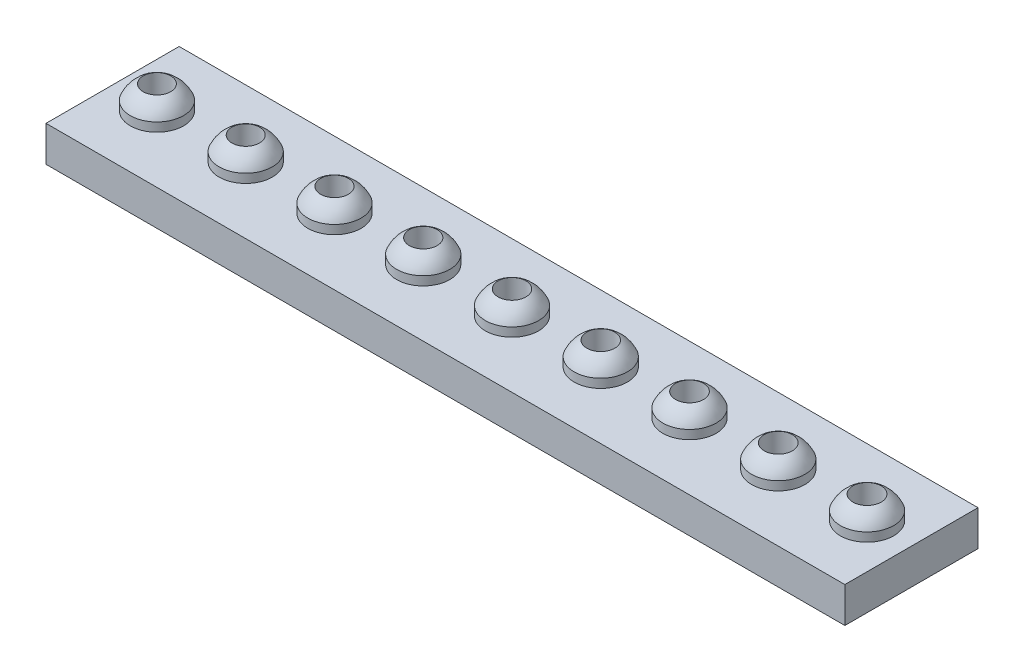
ISO-10303-21;
HEADER;
FILE_DESCRIPTION(('STEP AP214'),'2;1');
FILE_NAME('part.step','',(''),(''),'','','');
FILE_SCHEMA(('AUTOMOTIVE_DESIGN { 1 0 10303 214 1 1 1 1 }'));
ENDSEC;
DATA;
#1=APPLICATION_CONTEXT('core data for automotive mechanical design processes');
#2=APPLICATION_PROTOCOL_DEFINITION('international standard','automotive_design',2000,#1);
#3=PRODUCT_CONTEXT('',#1,'mechanical');
#4=PRODUCT('Part','Part','',(#3));
#5=PRODUCT_RELATED_PRODUCT_CATEGORY('part','',(#4));
#6=PRODUCT_DEFINITION_FORMATION('','',#4);
#7=PRODUCT_DEFINITION_CONTEXT('part definition',#1,'design');
#8=PRODUCT_DEFINITION('design','',#6,#7);
#9=PRODUCT_DEFINITION_SHAPE('','',#8);
#10=(LENGTH_UNIT() NAMED_UNIT(*) SI_UNIT(.MILLI.,.METRE.));
#11=(NAMED_UNIT(*) PLANE_ANGLE_UNIT() SI_UNIT($,.RADIAN.));
#12=(NAMED_UNIT(*) SI_UNIT($,.STERADIAN.) SOLID_ANGLE_UNIT());
#13=UNCERTAINTY_MEASURE_WITH_UNIT(LENGTH_MEASURE(1.E-05),#10,'distance_accuracy_value','');
#14=(GEOMETRIC_REPRESENTATION_CONTEXT(3) GLOBAL_UNCERTAINTY_ASSIGNED_CONTEXT((#13)) GLOBAL_UNIT_ASSIGNED_CONTEXT((#10,
#11,#12)) REPRESENTATION_CONTEXT('',''));
#15=CARTESIAN_POINT('',(0.,0.,0.));
#16=DIRECTION('',(0.,0.,1.));
#17=DIRECTION('',(1.,0.,0.));
#18=AXIS2_PLACEMENT_3D('',#15,#16,#17);
#19=CARTESIAN_POINT('',(45.,3.75,7.5));
#20=DIRECTION('',(0.,0.,1.));
#21=DIRECTION('',(1.,0.,0.));
#22=AXIS2_PLACEMENT_3D('',#19,#20,#21);
#23=SPHERICAL_SURFACE('',#22,3.25);
#24=CARTESIAN_POINT('',(45.,3.75,7.5));
#25=DIRECTION('',(0.,1.,0.));
#26=DIRECTION('',(0.,0.,1.));
#27=AXIS2_PLACEMENT_3D('',#24,#25,#26);
#28=SPHERICAL_SURFACE('',#27,3.25);
#29=CARTESIAN_POINT('',(45.,5.,7.5));
#30=DIRECTION('',(0.,1.,0.));
#31=DIRECTION('',(0.,0.,1.));
#32=AXIS2_PLACEMENT_3D('',#29,#30,#31);
#33=CIRCLE('',#32,3.);
#34=CARTESIAN_POINT('',(45.,5.,10.5));
#35=VERTEX_POINT('',#34);
#36=EDGE_CURVE('E42',#35,#35,#33,.T.);
#37=ORIENTED_EDGE('',*,*,#36,.T.);
#38=EDGE_LOOP('',(#37));
#39=FACE_BOUND('',#38,.T.);
#40=CARTESIAN_POINT('',(45.,6.59562822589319,7.5));
#41=DIRECTION('',(0.,-1.,0.));
#42=DIRECTION('',(0.,0.,-1.));
#43=AXIS2_PLACEMENT_3D('',#40,#41,#42);
#44=CIRCLE('',#43,1.57);
#45=CARTESIAN_POINT('',(45.,6.59562822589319,5.93));
#46=VERTEX_POINT('',#45);
#47=EDGE_CURVE('E189',#46,#46,#44,.F.);
#48=ORIENTED_EDGE('',*,*,#47,.F.);
#49=EDGE_LOOP('',(#48));
#50=FACE_BOUND('',#49,.T.);
#51=ADVANCED_FACE('F39',(#39,#50),#28,.T.);
#52=CARTESIAN_POINT('',(35.,3.75,7.5));
#53=DIRECTION('',(0.,0.,1.));
#54=DIRECTION('',(1.,0.,0.));
#55=AXIS2_PLACEMENT_3D('',#52,#53,#54);
#56=SPHERICAL_SURFACE('',#55,3.25);
#57=CARTESIAN_POINT('',(35.,3.75,7.5));
#58=DIRECTION('',(0.,1.,0.));
#59=DIRECTION('',(0.,0.,1.));
#60=AXIS2_PLACEMENT_3D('',#57,#58,#59);
#61=SPHERICAL_SURFACE('',#60,3.25);
#62=CARTESIAN_POINT('',(35.,5.,7.5));
#63=DIRECTION('',(0.,1.,0.));
#64=DIRECTION('',(0.,0.,1.));
#65=AXIS2_PLACEMENT_3D('',#62,#63,#64);
#66=CIRCLE('',#65,3.);
#67=CARTESIAN_POINT('',(35.,5.,10.5));
#68=VERTEX_POINT('',#67);
#69=EDGE_CURVE('E118',#68,#68,#66,.T.);
#70=ORIENTED_EDGE('',*,*,#69,.T.);
#71=EDGE_LOOP('',(#70));
#72=FACE_BOUND('',#71,.T.);
#73=CARTESIAN_POINT('',(35.,6.59838111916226,7.5));
#74=DIRECTION('',(0.,-1.,0.));
#75=DIRECTION('',(0.,0.,-1.));
#76=AXIS2_PLACEMENT_3D('',#73,#74,#75);
#77=CIRCLE('',#76,1.565);
#78=CARTESIAN_POINT('',(35.,6.59838111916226,5.935));
#79=VERTEX_POINT('',#78);
#80=EDGE_CURVE('E195',#79,#79,#77,.F.);
#81=ORIENTED_EDGE('',*,*,#80,.F.);
#82=EDGE_LOOP('',(#81));
#83=FACE_BOUND('',#82,.T.);
#84=ADVANCED_FACE('F254',(#72,#83),#61,.T.);
#85=CARTESIAN_POINT('',(25.,3.75,7.5));
#86=DIRECTION('',(0.,0.,1.));
#87=DIRECTION('',(1.,0.,0.));
#88=AXIS2_PLACEMENT_3D('',#85,#86,#87);
#89=SPHERICAL_SURFACE('',#88,3.25);
#90=CARTESIAN_POINT('',(25.,3.75,7.5));
#91=DIRECTION('',(0.,1.,0.));
#92=DIRECTION('',(0.,0.,1.));
#93=AXIS2_PLACEMENT_3D('',#90,#91,#92);
#94=SPHERICAL_SURFACE('',#93,3.25);
#95=CARTESIAN_POINT('',(25.,5.,7.5));
#96=DIRECTION('',(0.,1.,0.));
#97=DIRECTION('',(0.,0.,1.));
#98=AXIS2_PLACEMENT_3D('',#95,#96,#97);
#99=CIRCLE('',#98,3.);
#100=CARTESIAN_POINT('',(25.,5.,10.5));
#101=VERTEX_POINT('',#100);
#102=EDGE_CURVE('E124',#101,#101,#99,.T.);
#103=ORIENTED_EDGE('',*,*,#102,.T.);
#104=EDGE_LOOP('',(#103));
#105=FACE_BOUND('',#104,.T.);
#106=CARTESIAN_POINT('',(25.,6.60112258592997,7.5));
#107=DIRECTION('',(0.,-1.,0.));
#108=DIRECTION('',(0.,0.,-1.));
#109=AXIS2_PLACEMENT_3D('',#106,#107,#108);
#110=CIRCLE('',#109,1.56);
#111=CARTESIAN_POINT('',(25.,6.60112258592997,5.94));
#112=VERTEX_POINT('',#111);
#113=EDGE_CURVE('E201',#112,#112,#110,.F.);
#114=ORIENTED_EDGE('',*,*,#113,.F.);
#115=EDGE_LOOP('',(#114));
#116=FACE_BOUND('',#115,.T.);
#117=ADVANCED_FACE('F259',(#105,#116),#94,.T.);
#118=CARTESIAN_POINT('',(15.,3.75,7.5));
#119=DIRECTION('',(0.,0.,1.));
#120=DIRECTION('',(1.,0.,0.));
#121=AXIS2_PLACEMENT_3D('',#118,#119,#120);
#122=SPHERICAL_SURFACE('',#121,3.25);
#123=CARTESIAN_POINT('',(15.,3.75,7.5));
#124=DIRECTION('',(0.,1.,0.));
#125=DIRECTION('',(0.,0.,1.));
#126=AXIS2_PLACEMENT_3D('',#123,#124,#125);
#127=SPHERICAL_SURFACE('',#126,3.25);
#128=CARTESIAN_POINT('',(15.,5.,7.5));
#129=DIRECTION('',(0.,1.,0.));
#130=DIRECTION('',(0.,0.,1.));
#131=AXIS2_PLACEMENT_3D('',#128,#129,#130);
#132=CIRCLE('',#131,3.);
#133=CARTESIAN_POINT('',(15.,5.,10.5));
#134=VERTEX_POINT('',#133);
#135=EDGE_CURVE('E130',#134,#134,#132,.T.);
#136=ORIENTED_EDGE('',*,*,#135,.T.);
#137=EDGE_LOOP('',(#136));
#138=FACE_BOUND('',#137,.T.);
#139=CARTESIAN_POINT('',(15.,6.60385265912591,7.5));
#140=DIRECTION('',(0.,-1.,0.));
#141=DIRECTION('',(0.,0.,-1.));
#142=AXIS2_PLACEMENT_3D('',#139,#140,#141);
#143=CIRCLE('',#142,1.555);
#144=CARTESIAN_POINT('',(15.,6.60385265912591,5.945));
#145=VERTEX_POINT('',#144);
#146=EDGE_CURVE('E207',#145,#145,#143,.F.);
#147=ORIENTED_EDGE('',*,*,#146,.F.);
#148=EDGE_LOOP('',(#147));
#149=FACE_BOUND('',#148,.T.);
#150=ADVANCED_FACE('F333',(#138,#149),#127,.T.);
#151=CARTESIAN_POINT('',(4.99999999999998,3.75,7.5));
#152=DIRECTION('',(0.,0.,1.));
#153=DIRECTION('',(1.,0.,0.));
#154=AXIS2_PLACEMENT_3D('',#151,#152,#153);
#155=SPHERICAL_SURFACE('',#154,3.25);
#156=CARTESIAN_POINT('',(4.99999999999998,3.75,7.5));
#157=DIRECTION('',(0.,1.,0.));
#158=DIRECTION('',(0.,0.,1.));
#159=AXIS2_PLACEMENT_3D('',#156,#157,#158);
#160=SPHERICAL_SURFACE('',#159,3.25);
#161=CARTESIAN_POINT('',(4.99999999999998,5.,7.5));
#162=DIRECTION('',(0.,1.,0.));
#163=DIRECTION('',(0.,0.,1.));
#164=AXIS2_PLACEMENT_3D('',#161,#162,#163);
#165=CIRCLE('',#164,3.);
#166=CARTESIAN_POINT('',(4.99999999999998,5.,10.5));
#167=VERTEX_POINT('',#166);
#168=EDGE_CURVE('E136',#167,#167,#165,.T.);
#169=ORIENTED_EDGE('',*,*,#168,.T.);
#170=EDGE_LOOP('',(#169));
#171=FACE_BOUND('',#170,.T.);
#172=CARTESIAN_POINT('',(4.99999999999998,6.60657137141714,7.5));
#173=DIRECTION('',(0.,-1.,0.));
#174=DIRECTION('',(0.,0.,-1.));
#175=AXIS2_PLACEMENT_3D('',#172,#173,#174);
#176=CIRCLE('',#175,1.55);
#177=CARTESIAN_POINT('',(4.99999999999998,6.60657137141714,5.95));
#178=VERTEX_POINT('',#177);
#179=EDGE_CURVE('E166',#178,#178,#176,.F.);
#180=ORIENTED_EDGE('',*,*,#179,.F.);
#181=EDGE_LOOP('',(#180));
#182=FACE_BOUND('',#181,.T.);
#183=ADVANCED_FACE('F325',(#171,#182),#160,.T.);
#184=CARTESIAN_POINT('',(55.,3.75,7.5));
#185=DIRECTION('',(0.,0.,1.));
#186=DIRECTION('',(1.,0.,0.));
#187=AXIS2_PLACEMENT_3D('',#184,#185,#186);
#188=SPHERICAL_SURFACE('',#187,3.25);
#189=CARTESIAN_POINT('',(55.,3.75,7.5));
#190=DIRECTION('',(0.,1.,0.));
#191=DIRECTION('',(0.,0.,1.));
#192=AXIS2_PLACEMENT_3D('',#189,#190,#191);
#193=SPHERICAL_SURFACE('',#192,3.25);
#194=CARTESIAN_POINT('',(55.,5.,7.5));
#195=DIRECTION('',(0.,1.,0.));
#196=DIRECTION('',(0.,0.,1.));
#197=AXIS2_PLACEMENT_3D('',#194,#195,#196);
#198=CIRCLE('',#197,3.);
#199=CARTESIAN_POINT('',(55.,5.,10.5));
#200=VERTEX_POINT('',#199);
#201=EDGE_CURVE('E142',#200,#200,#198,.T.);
#202=ORIENTED_EDGE('',*,*,#201,.T.);
#203=EDGE_LOOP('',(#202));
#204=FACE_BOUND('',#203,.T.);
#205=CARTESIAN_POINT('',(55.,6.59286387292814,7.5));
#206=DIRECTION('',(0.,-1.,0.));
#207=DIRECTION('',(0.,0.,-1.));
#208=AXIS2_PLACEMENT_3D('',#205,#206,#207);
#209=CIRCLE('',#208,1.575);
#210=CARTESIAN_POINT('',(55.,6.59286387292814,5.925));
#211=VERTEX_POINT('',#210);
#212=EDGE_CURVE('E183',#211,#211,#209,.F.);
#213=ORIENTED_EDGE('',*,*,#212,.F.);
#214=EDGE_LOOP('',(#213));
#215=FACE_BOUND('',#214,.T.);
#216=ADVANCED_FACE('F317',(#204,#215),#193,.T.);
#217=CARTESIAN_POINT('',(65.,3.75,7.5));
#218=DIRECTION('',(0.,0.,1.));
#219=DIRECTION('',(1.,0.,0.));
#220=AXIS2_PLACEMENT_3D('',#217,#218,#219);
#221=SPHERICAL_SURFACE('',#220,3.25);
#222=CARTESIAN_POINT('',(65.,3.75,7.5));
#223=DIRECTION('',(0.,1.,0.));
#224=DIRECTION('',(0.,0.,1.));
#225=AXIS2_PLACEMENT_3D('',#222,#223,#224);
#226=SPHERICAL_SURFACE('',#225,3.25);
#227=CARTESIAN_POINT('',(65.,5.,7.5));
#228=DIRECTION('',(0.,1.,0.));
#229=DIRECTION('',(0.,0.,1.));
#230=AXIS2_PLACEMENT_3D('',#227,#228,#229);
#231=CIRCLE('',#230,3.);
#232=CARTESIAN_POINT('',(65.,5.,10.5));
#233=VERTEX_POINT('',#232);
#234=EDGE_CURVE('E148',#233,#233,#231,.T.);
#235=ORIENTED_EDGE('',*,*,#234,.T.);
#236=EDGE_LOOP('',(#235));
#237=FACE_BOUND('',#236,.T.);
#238=CARTESIAN_POINT('',(65.,6.59008802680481,7.5));
#239=DIRECTION('',(0.,-1.,0.));
#240=DIRECTION('',(0.,0.,-1.));
#241=AXIS2_PLACEMENT_3D('',#238,#239,#240);
#242=CIRCLE('',#241,1.58);
#243=CARTESIAN_POINT('',(65.,6.59008802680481,5.92));
#244=VERTEX_POINT('',#243);
#245=EDGE_CURVE('E177',#244,#244,#242,.F.);
#246=ORIENTED_EDGE('',*,*,#245,.F.);
#247=EDGE_LOOP('',(#246));
#248=FACE_BOUND('',#247,.T.);
#249=ADVANCED_FACE('F309',(#237,#248),#226,.T.);
#250=CARTESIAN_POINT('',(75.,3.75,7.5));
#251=DIRECTION('',(0.,0.,1.));
#252=DIRECTION('',(1.,0.,0.));
#253=AXIS2_PLACEMENT_3D('',#250,#251,#252);
#254=SPHERICAL_SURFACE('',#253,3.25);
#255=CARTESIAN_POINT('',(75.,3.75,7.5));
#256=DIRECTION('',(0.,1.,0.));
#257=DIRECTION('',(0.,0.,1.));
#258=AXIS2_PLACEMENT_3D('',#255,#256,#257);
#259=SPHERICAL_SURFACE('',#258,3.25);
#260=CARTESIAN_POINT('',(75.,5.,7.5));
#261=DIRECTION('',(0.,1.,0.));
#262=DIRECTION('',(0.,0.,1.));
#263=AXIS2_PLACEMENT_3D('',#260,#261,#262);
#264=CIRCLE('',#263,3.);
#265=CARTESIAN_POINT('',(75.,5.,10.5));
#266=VERTEX_POINT('',#265);
#267=EDGE_CURVE('E154',#266,#266,#264,.T.);
#268=ORIENTED_EDGE('',*,*,#267,.T.);
#269=EDGE_LOOP('',(#268));
#270=FACE_BOUND('',#269,.T.);
#271=CARTESIAN_POINT('',(75.,6.5873006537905,7.5));
#272=DIRECTION('',(0.,-1.,0.));
#273=DIRECTION('',(0.,0.,-1.));
#274=AXIS2_PLACEMENT_3D('',#271,#272,#273);
#275=CIRCLE('',#274,1.585);
#276=CARTESIAN_POINT('',(75.,6.5873006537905,5.915));
#277=VERTEX_POINT('',#276);
#278=EDGE_CURVE('E170',#277,#277,#275,.F.);
#279=ORIENTED_EDGE('',*,*,#278,.F.);
#280=EDGE_LOOP('',(#279));
#281=FACE_BOUND('',#280,.T.);
#282=ADVANCED_FACE('F301',(#270,#281),#259,.T.);
#283=CARTESIAN_POINT('',(85.,3.75,7.5));
#284=DIRECTION('',(0.,0.,1.));
#285=DIRECTION('',(1.,0.,0.));
#286=AXIS2_PLACEMENT_3D('',#283,#284,#285);
#287=SPHERICAL_SURFACE('',#286,3.25);
#288=CARTESIAN_POINT('',(85.,3.75,7.5));
#289=DIRECTION('',(0.,1.,0.));
#290=DIRECTION('',(0.,0.,1.));
#291=AXIS2_PLACEMENT_3D('',#288,#289,#290);
#292=SPHERICAL_SURFACE('',#291,3.25);
#293=CARTESIAN_POINT('',(85.,5.,7.5));
#294=DIRECTION('',(0.,1.,0.));
#295=DIRECTION('',(0.,0.,1.));
#296=AXIS2_PLACEMENT_3D('',#293,#294,#295);
#297=CIRCLE('',#296,3.);
#298=CARTESIAN_POINT('',(85.,5.,10.5));
#299=VERTEX_POINT('',#298);
#300=EDGE_CURVE('E160',#299,#299,#297,.T.);
#301=ORIENTED_EDGE('',*,*,#300,.T.);
#302=EDGE_LOOP('',(#301));
#303=FACE_BOUND('',#302,.T.);
#304=CARTESIAN_POINT('',(85.,6.58450171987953,7.5));
#305=DIRECTION('',(0.,-1.,0.));
#306=DIRECTION('',(0.,0.,-1.));
#307=AXIS2_PLACEMENT_3D('',#304,#305,#306);
#308=CIRCLE('',#307,1.58999999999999);
#309=CARTESIAN_POINT('',(85.,6.58450171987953,5.91000000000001));
#310=VERTEX_POINT('',#309);
#311=EDGE_CURVE('E171',#310,#310,#308,.F.);
#312=ORIENTED_EDGE('',*,*,#311,.F.);
#313=EDGE_LOOP('',(#312));
#314=FACE_BOUND('',#313,.T.);
#315=ADVANCED_FACE('F297',(#303,#314),#292,.T.);
#316=CARTESIAN_POINT('',(0.,4.,0.));
#317=DIRECTION('',(1.,0.,0.));
#318=DIRECTION('',(0.,0.,-1.));
#319=AXIS2_PLACEMENT_3D('',#316,#317,#318);
#320=PLANE('',#319);
#321=DIRECTION('',(0.,0.,1.));
#322=VECTOR('',#321,1.);
#323=CARTESIAN_POINT('',(0.,0.,0.));
#324=LINE('',#323,#322);
#325=CARTESIAN_POINT('',(0.,0.,0.));
#326=VERTEX_POINT('',#325);
#327=CARTESIAN_POINT('',(0.,0.,15.));
#328=VERTEX_POINT('',#327);
#329=EDGE_CURVE('E104',#326,#328,#324,.T.);
#330=ORIENTED_EDGE('',*,*,#329,.T.);
#331=DIRECTION('',(0.,-1.,0.));
#332=VECTOR('',#331,1.);
#333=CARTESIAN_POINT('',(0.,4.,15.));
#334=LINE('',#333,#332);
#335=CARTESIAN_POINT('',(0.,4.,15.));
#336=VERTEX_POINT('',#335);
#337=EDGE_CURVE('E11',#336,#328,#334,.T.);
#338=ORIENTED_EDGE('',*,*,#337,.F.);
#339=DIRECTION('',(0.,0.,1.));
#340=VECTOR('',#339,1.);
#341=CARTESIAN_POINT('',(0.,4.,0.));
#342=LINE('',#341,#340);
#343=CARTESIAN_POINT('',(0.,4.,0.));
#344=VERTEX_POINT('',#343);
#345=EDGE_CURVE('E89',#344,#336,#342,.T.);
#346=ORIENTED_EDGE('',*,*,#345,.F.);
#347=DIRECTION('',(0.,-1.,0.));
#348=VECTOR('',#347,1.);
#349=CARTESIAN_POINT('',(0.,4.,0.));
#350=LINE('',#349,#348);
#351=EDGE_CURVE('E56',#344,#326,#350,.T.);
#352=ORIENTED_EDGE('',*,*,#351,.T.);
#353=EDGE_LOOP('',(#330,#338,#346,#352));
#354=FACE_BOUND('',#353,.T.);
#355=ADVANCED_FACE('F300',(#354),#320,.F.);
#356=CARTESIAN_POINT('',(0.,4.,15.));
#357=DIRECTION('',(0.,0.,-1.));
#358=DIRECTION('',(-1.,0.,0.));
#359=AXIS2_PLACEMENT_3D('',#356,#357,#358);
#360=PLANE('',#359);
#361=DIRECTION('',(1.,0.,0.));
#362=VECTOR('',#361,1.);
#363=CARTESIAN_POINT('',(0.,0.,15.));
#364=LINE('',#363,#362);
#365=CARTESIAN_POINT('',(90.,0.,15.));
#366=VERTEX_POINT('',#365);
#367=EDGE_CURVE('E94',#328,#366,#364,.T.);
#368=ORIENTED_EDGE('',*,*,#367,.T.);
#369=DIRECTION('',(0.,-1.,0.));
#370=VECTOR('',#369,1.);
#371=CARTESIAN_POINT('',(90.,4.,15.));
#372=LINE('',#371,#370);
#373=CARTESIAN_POINT('',(90.,4.,15.));
#374=VERTEX_POINT('',#373);
#375=EDGE_CURVE('E48',#374,#366,#372,.T.);
#376=ORIENTED_EDGE('',*,*,#375,.F.);
#377=DIRECTION('',(1.,0.,0.));
#378=VECTOR('',#377,1.);
#379=CARTESIAN_POINT('',(0.,4.,15.));
#380=LINE('',#379,#378);
#381=EDGE_CURVE('E81',#336,#374,#380,.T.);
#382=ORIENTED_EDGE('',*,*,#381,.F.);
#383=ORIENTED_EDGE('',*,*,#337,.T.);
#384=EDGE_LOOP('',(#368,#376,#382,#383));
#385=FACE_BOUND('',#384,.T.);
#386=ADVANCED_FACE('F93',(#385),#360,.F.);
#387=CARTESIAN_POINT('',(90.,4.,0.));
#388=DIRECTION('',(1.,0.,0.));
#389=DIRECTION('',(0.,0.,-1.));
#390=AXIS2_PLACEMENT_3D('',#387,#388,#389);
#391=PLANE('',#390);
#392=DIRECTION('',(0.,0.,1.));
#393=VECTOR('',#392,1.);
#394=CARTESIAN_POINT('',(90.,0.,0.));
#395=LINE('',#394,#393);
#396=CARTESIAN_POINT('',(90.,0.,0.));
#397=VERTEX_POINT('',#396);
#398=EDGE_CURVE('E107',#397,#366,#395,.T.);
#399=ORIENTED_EDGE('',*,*,#398,.F.);
#400=DIRECTION('',(0.,-1.,0.));
#401=VECTOR('',#400,1.);
#402=CARTESIAN_POINT('',(90.,4.,0.));
#403=LINE('',#402,#401);
#404=CARTESIAN_POINT('',(90.,4.,0.));
#405=VERTEX_POINT('',#404);
#406=EDGE_CURVE('E70',#405,#397,#403,.T.);
#407=ORIENTED_EDGE('',*,*,#406,.F.);
#408=DIRECTION('',(0.,0.,1.));
#409=VECTOR('',#408,1.);
#410=CARTESIAN_POINT('',(90.,4.,0.));
#411=LINE('',#410,#409);
#412=EDGE_CURVE('E88',#405,#374,#411,.T.);
#413=ORIENTED_EDGE('',*,*,#412,.T.);
#414=ORIENTED_EDGE('',*,*,#375,.T.);
#415=EDGE_LOOP('',(#399,#407,#413,#414));
#416=FACE_BOUND('',#415,.T.);
#417=ADVANCED_FACE('F98',(#416),#391,.T.);
#418=CARTESIAN_POINT('',(0.,4.,0.));
#419=DIRECTION('',(0.,0.,-1.));
#420=DIRECTION('',(-1.,0.,0.));
#421=AXIS2_PLACEMENT_3D('',#418,#419,#420);
#422=PLANE('',#421);
#423=DIRECTION('',(1.,0.,0.));
#424=VECTOR('',#423,1.);
#425=CARTESIAN_POINT('',(0.,0.,0.));
#426=LINE('',#425,#424);
#427=EDGE_CURVE('E109',#326,#397,#426,.T.);
#428=ORIENTED_EDGE('',*,*,#427,.F.);
#429=ORIENTED_EDGE('',*,*,#351,.F.);
#430=DIRECTION('',(1.,0.,0.));
#431=VECTOR('',#430,1.);
#432=CARTESIAN_POINT('',(0.,4.,0.));
#433=LINE('',#432,#431);
#434=EDGE_CURVE('E99',#344,#405,#433,.T.);
#435=ORIENTED_EDGE('',*,*,#434,.T.);
#436=ORIENTED_EDGE('',*,*,#406,.T.);
#437=EDGE_LOOP('',(#428,#429,#435,#436));
#438=FACE_BOUND('',#437,.T.);
#439=ADVANCED_FACE('F243',(#438),#422,.T.);
#440=CARTESIAN_POINT('',(0.,4.,0.));
#441=DIRECTION('',(0.,1.,0.));
#442=DIRECTION('',(0.,0.,1.));
#443=AXIS2_PLACEMENT_3D('',#440,#441,#442);
#444=PLANE('',#443);
#445=CARTESIAN_POINT('',(85.,4.,7.5));
#446=DIRECTION('',(0.,1.,0.));
#447=DIRECTION('',(0.,0.,1.));
#448=AXIS2_PLACEMENT_3D('',#445,#446,#447);
#449=CIRCLE('',#448,3.);
#450=CARTESIAN_POINT('',(85.,4.,10.5));
#451=VERTEX_POINT('',#450);
#452=EDGE_CURVE('E163',#451,#451,#449,.T.);
#453=ORIENTED_EDGE('',*,*,#452,.F.);
#454=EDGE_LOOP('',(#453));
#455=FACE_BOUND('',#454,.T.);
#456=CARTESIAN_POINT('',(75.,4.,7.5));
#457=DIRECTION('',(0.,1.,0.));
#458=DIRECTION('',(0.,0.,1.));
#459=AXIS2_PLACEMENT_3D('',#456,#457,#458);
#460=CIRCLE('',#459,3.);
#461=CARTESIAN_POINT('',(75.,4.,10.5));
#462=VERTEX_POINT('',#461);
#463=EDGE_CURVE('E157',#462,#462,#460,.T.);
#464=ORIENTED_EDGE('',*,*,#463,.F.);
#465=EDGE_LOOP('',(#464));
#466=FACE_BOUND('',#465,.T.);
#467=CARTESIAN_POINT('',(65.,4.,7.5));
#468=DIRECTION('',(0.,1.,0.));
#469=DIRECTION('',(0.,0.,1.));
#470=AXIS2_PLACEMENT_3D('',#467,#468,#469);
#471=CIRCLE('',#470,3.);
#472=CARTESIAN_POINT('',(65.,4.,10.5));
#473=VERTEX_POINT('',#472);
#474=EDGE_CURVE('E151',#473,#473,#471,.T.);
#475=ORIENTED_EDGE('',*,*,#474,.F.);
#476=EDGE_LOOP('',(#475));
#477=FACE_BOUND('',#476,.T.);
#478=CARTESIAN_POINT('',(55.,4.,7.5));
#479=DIRECTION('',(0.,1.,0.));
#480=DIRECTION('',(0.,0.,1.));
#481=AXIS2_PLACEMENT_3D('',#478,#479,#480);
#482=CIRCLE('',#481,3.);
#483=CARTESIAN_POINT('',(55.,4.,10.5));
#484=VERTEX_POINT('',#483);
#485=EDGE_CURVE('E145',#484,#484,#482,.T.);
#486=ORIENTED_EDGE('',*,*,#485,.F.);
#487=EDGE_LOOP('',(#486));
#488=FACE_BOUND('',#487,.T.);
#489=CARTESIAN_POINT('',(4.99999999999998,4.,7.5));
#490=DIRECTION('',(0.,1.,0.));
#491=DIRECTION('',(0.,0.,1.));
#492=AXIS2_PLACEMENT_3D('',#489,#490,#491);
#493=CIRCLE('',#492,3.);
#494=CARTESIAN_POINT('',(4.99999999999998,4.,10.5));
#495=VERTEX_POINT('',#494);
#496=EDGE_CURVE('E139',#495,#495,#493,.T.);
#497=ORIENTED_EDGE('',*,*,#496,.F.);
#498=EDGE_LOOP('',(#497));
#499=FACE_BOUND('',#498,.T.);
#500=CARTESIAN_POINT('',(15.,4.,7.5));
#501=DIRECTION('',(0.,1.,0.));
#502=DIRECTION('',(0.,0.,1.));
#503=AXIS2_PLACEMENT_3D('',#500,#501,#502);
#504=CIRCLE('',#503,3.);
#505=CARTESIAN_POINT('',(15.,4.,10.5));
#506=VERTEX_POINT('',#505);
#507=EDGE_CURVE('E133',#506,#506,#504,.T.);
#508=ORIENTED_EDGE('',*,*,#507,.F.);
#509=EDGE_LOOP('',(#508));
#510=FACE_BOUND('',#509,.T.);
#511=CARTESIAN_POINT('',(25.,4.,7.5));
#512=DIRECTION('',(0.,1.,0.));
#513=DIRECTION('',(0.,0.,1.));
#514=AXIS2_PLACEMENT_3D('',#511,#512,#513);
#515=CIRCLE('',#514,3.);
#516=CARTESIAN_POINT('',(25.,4.,10.5));
#517=VERTEX_POINT('',#516);
#518=EDGE_CURVE('E127',#517,#517,#515,.T.);
#519=ORIENTED_EDGE('',*,*,#518,.F.);
#520=EDGE_LOOP('',(#519));
#521=FACE_BOUND('',#520,.T.);
#522=CARTESIAN_POINT('',(35.,4.,7.5));
#523=DIRECTION('',(0.,1.,0.));
#524=DIRECTION('',(0.,0.,1.));
#525=AXIS2_PLACEMENT_3D('',#522,#523,#524);
#526=CIRCLE('',#525,3.);
#527=CARTESIAN_POINT('',(35.,4.,10.5));
#528=VERTEX_POINT('',#527);
#529=EDGE_CURVE('E121',#528,#528,#526,.T.);
#530=ORIENTED_EDGE('',*,*,#529,.F.);
#531=EDGE_LOOP('',(#530));
#532=FACE_BOUND('',#531,.T.);
#533=CARTESIAN_POINT('',(45.,4.,7.5));
#534=DIRECTION('',(0.,1.,0.));
#535=DIRECTION('',(0.,0.,1.));
#536=AXIS2_PLACEMENT_3D('',#533,#534,#535);
#537=CIRCLE('',#536,3.);
#538=CARTESIAN_POINT('',(45.,4.,10.5));
#539=VERTEX_POINT('',#538);
#540=EDGE_CURVE('E115',#539,#539,#537,.T.);
#541=ORIENTED_EDGE('',*,*,#540,.F.);
#542=EDGE_LOOP('',(#541));
#543=FACE_BOUND('',#542,.T.);
#544=ORIENTED_EDGE('',*,*,#345,.T.);
#545=ORIENTED_EDGE('',*,*,#381,.T.);
#546=ORIENTED_EDGE('',*,*,#412,.F.);
#547=ORIENTED_EDGE('',*,*,#434,.F.);
#548=EDGE_LOOP('',(#544,#545,#546,#547));
#549=FACE_BOUND('',#548,.T.);
#550=ADVANCED_FACE('F85',(#455,#466,#477,#488,#499,#510,#521,#532,#543,#549),#444,.T.);
#551=CARTESIAN_POINT('',(0.,0.,0.));
#552=DIRECTION('',(0.,1.,0.));
#553=DIRECTION('',(0.,0.,1.));
#554=AXIS2_PLACEMENT_3D('',#551,#552,#553);
#555=PLANE('',#554);
#556=CARTESIAN_POINT('',(4.99999999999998,0.,7.5));
#557=DIRECTION('',(0.,1.,0.));
#558=DIRECTION('',(0.,0.,1.));
#559=AXIS2_PLACEMENT_3D('',#556,#557,#558);
#560=CIRCLE('',#559,1.55);
#561=CARTESIAN_POINT('',(4.99999999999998,0.,5.95));
#562=VERTEX_POINT('',#561);
#563=EDGE_CURVE('E213',#562,#562,#560,.F.);
#564=ORIENTED_EDGE('',*,*,#563,.F.);
#565=EDGE_LOOP('',(#564));
#566=FACE_BOUND('',#565,.T.);
#567=CARTESIAN_POINT('',(15.,0.,7.5));
#568=DIRECTION('',(0.,1.,0.));
#569=DIRECTION('',(0.,0.,1.));
#570=AXIS2_PLACEMENT_3D('',#567,#568,#569);
#571=CIRCLE('',#570,1.555);
#572=CARTESIAN_POINT('',(15.,0.,5.945));
#573=VERTEX_POINT('',#572);
#574=EDGE_CURVE('E210',#573,#573,#571,.F.);
#575=ORIENTED_EDGE('',*,*,#574,.F.);
#576=EDGE_LOOP('',(#575));
#577=FACE_BOUND('',#576,.T.);
#578=CARTESIAN_POINT('',(25.,0.,7.5));
#579=DIRECTION('',(0.,1.,0.));
#580=DIRECTION('',(0.,0.,1.));
#581=AXIS2_PLACEMENT_3D('',#578,#579,#580);
#582=CIRCLE('',#581,1.56);
#583=CARTESIAN_POINT('',(25.,0.,5.94));
#584=VERTEX_POINT('',#583);
#585=EDGE_CURVE('E204',#584,#584,#582,.F.);
#586=ORIENTED_EDGE('',*,*,#585,.F.);
#587=EDGE_LOOP('',(#586));
#588=FACE_BOUND('',#587,.T.);
#589=CARTESIAN_POINT('',(35.,0.,7.5));
#590=DIRECTION('',(0.,1.,0.));
#591=DIRECTION('',(0.,0.,1.));
#592=AXIS2_PLACEMENT_3D('',#589,#590,#591);
#593=CIRCLE('',#592,1.565);
#594=CARTESIAN_POINT('',(35.,0.,5.935));
#595=VERTEX_POINT('',#594);
#596=EDGE_CURVE('E198',#595,#595,#593,.F.);
#597=ORIENTED_EDGE('',*,*,#596,.F.);
#598=EDGE_LOOP('',(#597));
#599=FACE_BOUND('',#598,.T.);
#600=CARTESIAN_POINT('',(45.,0.,7.5));
#601=DIRECTION('',(0.,1.,0.));
#602=DIRECTION('',(0.,0.,1.));
#603=AXIS2_PLACEMENT_3D('',#600,#601,#602);
#604=CIRCLE('',#603,1.57);
#605=CARTESIAN_POINT('',(45.,0.,5.93));
#606=VERTEX_POINT('',#605);
#607=EDGE_CURVE('E192',#606,#606,#604,.F.);
#608=ORIENTED_EDGE('',*,*,#607,.F.);
#609=EDGE_LOOP('',(#608));
#610=FACE_BOUND('',#609,.T.);
#611=CARTESIAN_POINT('',(55.,0.,7.5));
#612=DIRECTION('',(0.,1.,0.));
#613=DIRECTION('',(0.,0.,1.));
#614=AXIS2_PLACEMENT_3D('',#611,#612,#613);
#615=CIRCLE('',#614,1.575);
#616=CARTESIAN_POINT('',(55.,0.,5.925));
#617=VERTEX_POINT('',#616);
#618=EDGE_CURVE('E186',#617,#617,#615,.F.);
#619=ORIENTED_EDGE('',*,*,#618,.F.);
#620=EDGE_LOOP('',(#619));
#621=FACE_BOUND('',#620,.T.);
#622=CARTESIAN_POINT('',(65.,0.,7.5));
#623=DIRECTION('',(0.,1.,0.));
#624=DIRECTION('',(0.,0.,1.));
#625=AXIS2_PLACEMENT_3D('',#622,#623,#624);
#626=CIRCLE('',#625,1.58);
#627=CARTESIAN_POINT('',(65.,0.,5.92));
#628=VERTEX_POINT('',#627);
#629=EDGE_CURVE('E180',#628,#628,#626,.F.);
#630=ORIENTED_EDGE('',*,*,#629,.F.);
#631=EDGE_LOOP('',(#630));
#632=FACE_BOUND('',#631,.T.);
#633=CARTESIAN_POINT('',(75.,0.,7.5));
#634=DIRECTION('',(0.,1.,0.));
#635=DIRECTION('',(0.,0.,1.));
#636=AXIS2_PLACEMENT_3D('',#633,#634,#635);
#637=CIRCLE('',#636,1.585);
#638=CARTESIAN_POINT('',(75.,0.,5.915));
#639=VERTEX_POINT('',#638);
#640=EDGE_CURVE('E174',#639,#639,#637,.F.);
#641=ORIENTED_EDGE('',*,*,#640,.F.);
#642=EDGE_LOOP('',(#641));
#643=FACE_BOUND('',#642,.T.);
#644=CARTESIAN_POINT('',(85.,0.,7.5));
#645=DIRECTION('',(0.,1.,0.));
#646=DIRECTION('',(0.,0.,1.));
#647=AXIS2_PLACEMENT_3D('',#644,#645,#646);
#648=CIRCLE('',#647,1.58999999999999);
#649=CARTESIAN_POINT('',(85.,0.,5.91000000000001));
#650=VERTEX_POINT('',#649);
#651=EDGE_CURVE('E167',#650,#650,#648,.F.);
#652=ORIENTED_EDGE('',*,*,#651,.F.);
#653=EDGE_LOOP('',(#652));
#654=FACE_BOUND('',#653,.T.);
#655=ORIENTED_EDGE('',*,*,#329,.F.);
#656=ORIENTED_EDGE('',*,*,#427,.T.);
#657=ORIENTED_EDGE('',*,*,#398,.T.);
#658=ORIENTED_EDGE('',*,*,#367,.F.);
#659=EDGE_LOOP('',(#655,#656,#657,#658));
#660=FACE_BOUND('',#659,.T.);
#661=ADVANCED_FACE('F223',(#566,#577,#588,#599,#610,#621,#632,#643,#654,#660),#555,.F.);
#662=CARTESIAN_POINT('',(45.,5.,7.5));
#663=DIRECTION('',(0.,-1.,0.));
#664=DIRECTION('',(0.,0.,-1.));
#665=AXIS2_PLACEMENT_3D('',#662,#663,#664);
#666=CYLINDRICAL_SURFACE('',#665,3.);
#667=ORIENTED_EDGE('',*,*,#36,.F.);
#668=EDGE_LOOP('',(#667));
#669=FACE_BOUND('',#668,.T.);
#670=ORIENTED_EDGE('',*,*,#540,.T.);
#671=EDGE_LOOP('',(#670));
#672=FACE_BOUND('',#671,.T.);
#673=ADVANCED_FACE('F226',(#669,#672),#666,.T.);
#674=CARTESIAN_POINT('',(35.,5.,7.5));
#675=DIRECTION('',(0.,-1.,0.));
#676=DIRECTION('',(0.,0.,-1.));
#677=AXIS2_PLACEMENT_3D('',#674,#675,#676);
#678=CYLINDRICAL_SURFACE('',#677,3.);
#679=ORIENTED_EDGE('',*,*,#69,.F.);
#680=EDGE_LOOP('',(#679));
#681=FACE_BOUND('',#680,.T.);
#682=ORIENTED_EDGE('',*,*,#529,.T.);
#683=EDGE_LOOP('',(#682));
#684=FACE_BOUND('',#683,.T.);
#685=ADVANCED_FACE('F350',(#681,#684),#678,.T.);
#686=CARTESIAN_POINT('',(25.,5.,7.5));
#687=DIRECTION('',(0.,-1.,0.));
#688=DIRECTION('',(0.,0.,-1.));
#689=AXIS2_PLACEMENT_3D('',#686,#687,#688);
#690=CYLINDRICAL_SURFACE('',#689,3.);
#691=ORIENTED_EDGE('',*,*,#102,.F.);
#692=EDGE_LOOP('',(#691));
#693=FACE_BOUND('',#692,.T.);
#694=ORIENTED_EDGE('',*,*,#518,.T.);
#695=EDGE_LOOP('',(#694));
#696=FACE_BOUND('',#695,.T.);
#697=ADVANCED_FACE('F344',(#693,#696),#690,.T.);
#698=CARTESIAN_POINT('',(15.,5.,7.5));
#699=DIRECTION('',(0.,-1.,0.));
#700=DIRECTION('',(0.,0.,-1.));
#701=AXIS2_PLACEMENT_3D('',#698,#699,#700);
#702=CYLINDRICAL_SURFACE('',#701,3.);
#703=ORIENTED_EDGE('',*,*,#135,.F.);
#704=EDGE_LOOP('',(#703));
#705=FACE_BOUND('',#704,.T.);
#706=ORIENTED_EDGE('',*,*,#507,.T.);
#707=EDGE_LOOP('',(#706));
#708=FACE_BOUND('',#707,.T.);
#709=ADVANCED_FACE('F337',(#705,#708),#702,.T.);
#710=CARTESIAN_POINT('',(4.99999999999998,5.,7.5));
#711=DIRECTION('',(0.,-1.,0.));
#712=DIRECTION('',(0.,0.,-1.));
#713=AXIS2_PLACEMENT_3D('',#710,#711,#712);
#714=CYLINDRICAL_SURFACE('',#713,3.);
#715=ORIENTED_EDGE('',*,*,#168,.F.);
#716=EDGE_LOOP('',(#715));
#717=FACE_BOUND('',#716,.T.);
#718=ORIENTED_EDGE('',*,*,#496,.T.);
#719=EDGE_LOOP('',(#718));
#720=FACE_BOUND('',#719,.T.);
#721=ADVANCED_FACE('F329',(#717,#720),#714,.T.);
#722=CARTESIAN_POINT('',(55.,5.,7.5));
#723=DIRECTION('',(0.,-1.,0.));
#724=DIRECTION('',(0.,0.,-1.));
#725=AXIS2_PLACEMENT_3D('',#722,#723,#724);
#726=CYLINDRICAL_SURFACE('',#725,3.);
#727=ORIENTED_EDGE('',*,*,#201,.F.);
#728=EDGE_LOOP('',(#727));
#729=FACE_BOUND('',#728,.T.);
#730=ORIENTED_EDGE('',*,*,#485,.T.);
#731=EDGE_LOOP('',(#730));
#732=FACE_BOUND('',#731,.T.);
#733=ADVANCED_FACE('F321',(#729,#732),#726,.T.);
#734=CARTESIAN_POINT('',(65.,5.,7.5));
#735=DIRECTION('',(0.,-1.,0.));
#736=DIRECTION('',(0.,0.,-1.));
#737=AXIS2_PLACEMENT_3D('',#734,#735,#736);
#738=CYLINDRICAL_SURFACE('',#737,3.);
#739=ORIENTED_EDGE('',*,*,#234,.F.);
#740=EDGE_LOOP('',(#739));
#741=FACE_BOUND('',#740,.T.);
#742=ORIENTED_EDGE('',*,*,#474,.T.);
#743=EDGE_LOOP('',(#742));
#744=FACE_BOUND('',#743,.T.);
#745=ADVANCED_FACE('F313',(#741,#744),#738,.T.);
#746=CARTESIAN_POINT('',(75.,5.,7.5));
#747=DIRECTION('',(0.,-1.,0.));
#748=DIRECTION('',(0.,0.,-1.));
#749=AXIS2_PLACEMENT_3D('',#746,#747,#748);
#750=CYLINDRICAL_SURFACE('',#749,3.);
#751=ORIENTED_EDGE('',*,*,#267,.F.);
#752=EDGE_LOOP('',(#751));
#753=FACE_BOUND('',#752,.T.);
#754=ORIENTED_EDGE('',*,*,#463,.T.);
#755=EDGE_LOOP('',(#754));
#756=FACE_BOUND('',#755,.T.);
#757=ADVANCED_FACE('F305',(#753,#756),#750,.T.);
#758=CARTESIAN_POINT('',(85.,5.,7.5));
#759=DIRECTION('',(0.,-1.,0.));
#760=DIRECTION('',(0.,0.,-1.));
#761=AXIS2_PLACEMENT_3D('',#758,#759,#760);
#762=CYLINDRICAL_SURFACE('',#761,3.);
#763=ORIENTED_EDGE('',*,*,#300,.F.);
#764=EDGE_LOOP('',(#763));
#765=FACE_BOUND('',#764,.T.);
#766=ORIENTED_EDGE('',*,*,#452,.T.);
#767=EDGE_LOOP('',(#766));
#768=FACE_BOUND('',#767,.T.);
#769=ADVANCED_FACE('F295',(#765,#768),#762,.T.);
#770=CARTESIAN_POINT('',(85.,7.001,7.5));
#771=DIRECTION('',(0.,-1.,0.));
#772=DIRECTION('',(0.,0.,-1.));
#773=AXIS2_PLACEMENT_3D('',#770,#771,#772);
#774=CYLINDRICAL_SURFACE('',#773,1.58999999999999);
#775=CARTESIAN_POINT('',(85.,6.58450171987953,5.91000000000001));
#776=CARTESIAN_POINT('',(85.,6.51591316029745,5.91000000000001));
#777=CARTESIAN_POINT('',(85.,6.44732460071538,5.91000000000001));
#778=CARTESIAN_POINT('',(85.,6.31014748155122,5.91000000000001));
#779=CARTESIAN_POINT('',(85.,6.24155892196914,5.91000000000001));
#780=CARTESIAN_POINT('',(85.,6.10438180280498,5.91000000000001));
#781=CARTESIAN_POINT('',(85.,6.0357932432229,5.91000000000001));
#782=CARTESIAN_POINT('',(85.,5.89861612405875,5.91000000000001));
#783=CARTESIAN_POINT('',(85.,5.83002756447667,5.91000000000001));
#784=CARTESIAN_POINT('',(85.,5.69285044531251,5.91000000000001));
#785=CARTESIAN_POINT('',(85.,5.62426188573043,5.91000000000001));
#786=CARTESIAN_POINT('',(85.,5.48708476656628,5.91000000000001));
#787=CARTESIAN_POINT('',(85.,5.4184962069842,5.91000000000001));
#788=CARTESIAN_POINT('',(85.,5.28131908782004,5.91000000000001));
#789=CARTESIAN_POINT('',(85.,5.21273052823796,5.91000000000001));
#790=CARTESIAN_POINT('',(85.,5.07555340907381,5.91000000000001));
#791=CARTESIAN_POINT('',(85.,5.00696484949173,5.91000000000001));
#792=CARTESIAN_POINT('',(85.,4.86978773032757,5.91000000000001));
#793=CARTESIAN_POINT('',(85.,4.80119917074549,5.91000000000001));
#794=CARTESIAN_POINT('',(85.,4.66402205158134,5.91000000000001));
#795=CARTESIAN_POINT('',(85.,4.59543349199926,5.91000000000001));
#796=CARTESIAN_POINT('',(85.,4.4582563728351,5.91000000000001));
#797=CARTESIAN_POINT('',(85.,4.38966781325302,5.91000000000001));
#798=CARTESIAN_POINT('',(85.,4.25249069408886,5.91000000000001));
#799=CARTESIAN_POINT('',(85.,4.18390213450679,5.91000000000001));
#800=CARTESIAN_POINT('',(85.,4.04672501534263,5.91000000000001));
#801=CARTESIAN_POINT('',(85.,3.97813645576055,5.91000000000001));
#802=CARTESIAN_POINT('',(85.,3.84095933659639,5.91000000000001));
#803=CARTESIAN_POINT('',(85.,3.77237077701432,5.91000000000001));
#804=CARTESIAN_POINT('',(85.,3.63519365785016,5.91000000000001));
#805=CARTESIAN_POINT('',(85.,3.56660509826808,5.91000000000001));
#806=CARTESIAN_POINT('',(85.,3.42942797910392,5.91000000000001));
#807=CARTESIAN_POINT('',(85.,3.36083941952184,5.91000000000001));
#808=CARTESIAN_POINT('',(85.,3.22366230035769,5.91000000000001));
#809=CARTESIAN_POINT('',(85.,3.15507374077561,5.91000000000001));
#810=CARTESIAN_POINT('',(85.,3.01789662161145,5.91000000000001));
#811=CARTESIAN_POINT('',(85.,2.94930806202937,5.91000000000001));
#812=CARTESIAN_POINT('',(85.,2.81213094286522,5.91000000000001));
#813=CARTESIAN_POINT('',(85.,2.74354238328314,5.91000000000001));
#814=CARTESIAN_POINT('',(85.,2.60636526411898,5.91000000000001));
#815=CARTESIAN_POINT('',(85.,2.5377767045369,5.91000000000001));
#816=CARTESIAN_POINT('',(85.,2.40059958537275,5.91000000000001));
#817=CARTESIAN_POINT('',(85.,2.33201102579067,5.91000000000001));
#818=CARTESIAN_POINT('',(85.,2.19483390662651,5.91000000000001));
#819=CARTESIAN_POINT('',(85.,2.12624534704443,5.91000000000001));
#820=CARTESIAN_POINT('',(85.,1.98906822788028,5.91000000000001));
#821=CARTESIAN_POINT('',(85.,1.9204796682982,5.91000000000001));
#822=CARTESIAN_POINT('',(85.,1.78330254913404,5.91000000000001));
#823=CARTESIAN_POINT('',(85.,1.71471398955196,5.91000000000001));
#824=CARTESIAN_POINT('',(85.,1.5775368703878,5.91000000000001));
#825=CARTESIAN_POINT('',(85.,1.50894831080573,5.91000000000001));
#826=CARTESIAN_POINT('',(85.,1.37177119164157,5.91000000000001));
#827=CARTESIAN_POINT('',(85.,1.30318263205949,5.91000000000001));
#828=CARTESIAN_POINT('',(85.,1.16600551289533,5.91000000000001));
#829=CARTESIAN_POINT('',(85.,1.09741695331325,5.91000000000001));
#830=CARTESIAN_POINT('',(85.,0.960239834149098,5.91000000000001));
#831=CARTESIAN_POINT('',(85.,0.89165127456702,5.91000000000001));
#832=CARTESIAN_POINT('',(85.,0.754474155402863,5.91000000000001));
#833=CARTESIAN_POINT('',(85.,0.685885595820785,5.91000000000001));
#834=CARTESIAN_POINT('',(85.,0.548708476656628,5.91000000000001));
#835=CARTESIAN_POINT('',(85.,0.480119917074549,5.91000000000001));
#836=CARTESIAN_POINT('',(85.,0.342942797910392,5.91000000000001));
#837=CARTESIAN_POINT('',(85.,0.274354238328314,5.91000000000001));
#838=CARTESIAN_POINT('',(85.,0.137177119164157,5.91000000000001));
#839=CARTESIAN_POINT('',(85.,0.0685885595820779,5.91000000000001));
#840=CARTESIAN_POINT('',(85.,0.,5.91000000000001));
#841=B_SPLINE_CURVE_WITH_KNOTS('',3,(#775,#776,#777,#778,#779,#780,#781,#782,#783,#784,#785,
#786,#787,#788,#789,#790,#791,#792,#793,#794,#795,#796,#797,#798,#799,#800,#801,#802,#803,#804,
#805,#806,#807,#808,#809,#810,#811,#812,#813,#814,#815,#816,#817,#818,#819,#820,#821,#822,#823,
#824,#825,#826,#827,#828,#829,#830,#831,#832,#833,#834,#835,#836,#837,#838,#839,#840),
.UNSPECIFIED.,.F.,.F.,(4,2,2,2,2,2,2,2,2,2,2,2,2,2,2,2,2,2,2,2,2,2,2,2,2,2,2,2,2,2,2,2,4),(0.,
0.205765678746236,0.411531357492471,0.617297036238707,0.823062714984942,1.02882839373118,
1.23459407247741,1.44035975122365,1.64612542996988,1.85189110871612,2.05765678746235,
2.26342246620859,2.46918814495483,2.67495382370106,2.8807195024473,3.08648518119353,
3.29225085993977,3.498016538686,3.70378221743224,3.90954789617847,4.11531357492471,
4.32107925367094,4.52684493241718,4.73261061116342,4.93837628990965,5.14414196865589,
5.34990764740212,5.55567332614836,5.76143900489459,5.96720468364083,6.17297036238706,
6.3787360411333,6.58450171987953),.UNSPECIFIED.);
#842=EDGE_CURVE('BSEAM291',#310,#650,#841,.T.);
#843=ORIENTED_EDGE('',*,*,#311,.T.);
#844=ORIENTED_EDGE('',*,*,#651,.T.);
#845=ORIENTED_EDGE('',*,*,#842,.T.);
#846=ORIENTED_EDGE('',*,*,#842,.F.);
#847=EDGE_LOOP('',(#843,#845,#844,#846));
#848=FACE_BOUND('',#847,.T.);
#849=ADVANCED_FACE('F291',(#848),#774,.F.);
#850=CARTESIAN_POINT('',(75.,7.001,7.5));
#851=DIRECTION('',(0.,-1.,0.));
#852=DIRECTION('',(0.,0.,-1.));
#853=AXIS2_PLACEMENT_3D('',#850,#851,#852);
#854=CYLINDRICAL_SURFACE('',#853,1.585);
#855=CARTESIAN_POINT('',(75.,6.5873006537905,5.915));
#856=CARTESIAN_POINT('',(75.,6.51868293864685,5.915));
#857=CARTESIAN_POINT('',(75.,6.4500652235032,5.915));
#858=CARTESIAN_POINT('',(75.,6.3128297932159,5.915));
#859=CARTESIAN_POINT('',(75.,6.24421207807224,5.915));
#860=CARTESIAN_POINT('',(75.,6.10697664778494,5.915));
#861=CARTESIAN_POINT('',(75.,6.03835893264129,5.915));
#862=CARTESIAN_POINT('',(75.,5.90112350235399,5.915));
#863=CARTESIAN_POINT('',(75.,5.83250578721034,5.915));
#864=CARTESIAN_POINT('',(75.,5.69527035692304,5.915));
#865=CARTESIAN_POINT('',(75.,5.62665264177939,5.915));
#866=CARTESIAN_POINT('',(75.,5.48941721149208,5.915));
#867=CARTESIAN_POINT('',(75.,5.42079949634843,5.915));
#868=CARTESIAN_POINT('',(75.,5.28356406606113,5.915));
#869=CARTESIAN_POINT('',(75.,5.21494635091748,5.915));
#870=CARTESIAN_POINT('',(75.,5.07771092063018,5.915));
#871=CARTESIAN_POINT('',(75.,5.00909320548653,5.915));
#872=CARTESIAN_POINT('',(75.,4.87185777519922,5.915));
#873=CARTESIAN_POINT('',(75.,4.80324006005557,5.915));
#874=CARTESIAN_POINT('',(75.,4.66600462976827,5.915));
#875=CARTESIAN_POINT('',(75.,4.59738691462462,5.915));
#876=CARTESIAN_POINT('',(75.,4.46015148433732,5.915));
#877=CARTESIAN_POINT('',(75.,4.39153376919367,5.915));
#878=CARTESIAN_POINT('',(75.,4.25429833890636,5.915));
#879=CARTESIAN_POINT('',(75.,4.18568062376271,5.915));
#880=CARTESIAN_POINT('',(75.,4.04844519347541,5.915));
#881=CARTESIAN_POINT('',(75.,3.97982747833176,5.915));
#882=CARTESIAN_POINT('',(75.,3.84259204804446,5.915));
#883=CARTESIAN_POINT('',(75.,3.77397433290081,5.915));
#884=CARTESIAN_POINT('',(75.,3.6367389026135,5.915));
#885=CARTESIAN_POINT('',(75.,3.56812118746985,5.915));
#886=CARTESIAN_POINT('',(75.,3.43088575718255,5.915));
#887=CARTESIAN_POINT('',(75.,3.3622680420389,5.915));
#888=CARTESIAN_POINT('',(75.,3.2250326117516,5.915));
#889=CARTESIAN_POINT('',(75.,3.15641489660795,5.915));
#890=CARTESIAN_POINT('',(75.,3.01917946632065,5.915));
#891=CARTESIAN_POINT('',(75.,2.95056175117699,5.915));
#892=CARTESIAN_POINT('',(75.,2.81332632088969,5.915));
#893=CARTESIAN_POINT('',(75.,2.74470860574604,5.915));
#894=CARTESIAN_POINT('',(75.,2.60747317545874,5.915));
#895=CARTESIAN_POINT('',(75.,2.53885546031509,5.915));
#896=CARTESIAN_POINT('',(75.,2.40162003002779,5.915));
#897=CARTESIAN_POINT('',(75.,2.33300231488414,5.915));
#898=CARTESIAN_POINT('',(75.,2.19576688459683,5.915));
#899=CARTESIAN_POINT('',(75.,2.12714916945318,5.915));
#900=CARTESIAN_POINT('',(75.,1.98991373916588,5.915));
#901=CARTESIAN_POINT('',(75.,1.92129602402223,5.915));
#902=CARTESIAN_POINT('',(75.,1.78406059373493,5.915));
#903=CARTESIAN_POINT('',(75.,1.71544287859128,5.915));
#904=CARTESIAN_POINT('',(75.,1.57820744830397,5.915));
#905=CARTESIAN_POINT('',(75.,1.50958973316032,5.915));
#906=CARTESIAN_POINT('',(75.,1.37235430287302,5.915));
#907=CARTESIAN_POINT('',(75.,1.30373658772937,5.915));
#908=CARTESIAN_POINT('',(75.,1.16650115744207,5.915));
#909=CARTESIAN_POINT('',(75.,1.09788344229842,5.915));
#910=CARTESIAN_POINT('',(75.,0.960648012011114,5.915));
#911=CARTESIAN_POINT('',(75.,0.892030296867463,5.915));
#912=CARTESIAN_POINT('',(75.,0.75479486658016,5.915));
#913=CARTESIAN_POINT('',(75.,0.68617715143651,5.915));
#914=CARTESIAN_POINT('',(75.,0.548941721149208,5.915));
#915=CARTESIAN_POINT('',(75.,0.480324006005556,5.915));
#916=CARTESIAN_POINT('',(75.,0.343088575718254,5.915));
#917=CARTESIAN_POINT('',(75.,0.274470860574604,5.915));
#918=CARTESIAN_POINT('',(75.,0.137235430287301,5.915));
#919=CARTESIAN_POINT('',(75.,0.0686177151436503,5.915));
#920=CARTESIAN_POINT('',(75.,0.,5.915));
#921=B_SPLINE_CURVE_WITH_KNOTS('',3,(#855,#856,#857,#858,#859,#860,#861,#862,#863,#864,#865,
#866,#867,#868,#869,#870,#871,#872,#873,#874,#875,#876,#877,#878,#879,#880,#881,#882,#883,#884,
#885,#886,#887,#888,#889,#890,#891,#892,#893,#894,#895,#896,#897,#898,#899,#900,#901,#902,#903,
#904,#905,#906,#907,#908,#909,#910,#911,#912,#913,#914,#915,#916,#917,#918,#919,#920),
.UNSPECIFIED.,.F.,.F.,(4,2,2,2,2,2,2,2,2,2,2,2,2,2,2,2,2,2,2,2,2,2,2,2,2,2,2,2,2,2,2,2,4),(0.,
0.205853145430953,0.411706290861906,0.617559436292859,0.823412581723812,1.02926572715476,
1.23511887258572,1.44097201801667,1.64682516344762,1.85267830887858,2.05853145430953,
2.26438459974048,2.47023774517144,2.67609089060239,2.88194403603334,3.0877971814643,
3.29365032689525,3.4995034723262,3.70535661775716,3.91120976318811,4.11706290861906,
4.32291605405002,4.52876919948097,4.73462234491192,4.94047549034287,5.14632863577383,
5.35218178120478,5.55803492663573,5.76388807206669,5.96974121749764,6.17559436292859,
6.38144750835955,6.5873006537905),.UNSPECIFIED.);
#922=EDGE_CURVE('BSEAM287',#277,#639,#921,.T.);
#923=ORIENTED_EDGE('',*,*,#278,.T.);
#924=ORIENTED_EDGE('',*,*,#640,.T.);
#925=ORIENTED_EDGE('',*,*,#922,.T.);
#926=ORIENTED_EDGE('',*,*,#922,.F.);
#927=EDGE_LOOP('',(#923,#925,#924,#926));
#928=FACE_BOUND('',#927,.T.);
#929=ADVANCED_FACE('F287',(#928),#854,.F.);
#930=CARTESIAN_POINT('',(65.,7.001,7.5));
#931=DIRECTION('',(0.,-1.,0.));
#932=DIRECTION('',(0.,0.,-1.));
#933=AXIS2_PLACEMENT_3D('',#930,#931,#932);
#934=CYLINDRICAL_SURFACE('',#933,1.58);
#935=CARTESIAN_POINT('',(65.,6.59008802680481,5.92));
#936=CARTESIAN_POINT('',(65.,6.52144127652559,5.92));
#937=CARTESIAN_POINT('',(65.,6.45279452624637,5.92));
#938=CARTESIAN_POINT('',(65.,6.31550102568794,5.92));
#939=CARTESIAN_POINT('',(65.,6.24685427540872,5.92));
#940=CARTESIAN_POINT('',(65.,6.10956077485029,5.92));
#941=CARTESIAN_POINT('',(65.,6.04091402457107,5.92));
#942=CARTESIAN_POINT('',(65.,5.90362052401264,5.92));
#943=CARTESIAN_POINT('',(65.,5.83497377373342,5.92));
#944=CARTESIAN_POINT('',(65.,5.69768027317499,5.92));
#945=CARTESIAN_POINT('',(65.,5.62903352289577,5.92));
#946=CARTESIAN_POINT('',(65.,5.49174002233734,5.92));
#947=CARTESIAN_POINT('',(65.,5.42309327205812,5.92));
#948=CARTESIAN_POINT('',(65.,5.28579977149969,5.92));
#949=CARTESIAN_POINT('',(65.,5.21715302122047,5.92));
#950=CARTESIAN_POINT('',(65.,5.07985952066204,5.92));
#951=CARTESIAN_POINT('',(65.,5.01121277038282,5.92));
#952=CARTESIAN_POINT('',(65.,4.87391926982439,5.92));
#953=CARTESIAN_POINT('',(65.,4.80527251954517,5.92));
#954=CARTESIAN_POINT('',(65.,4.66797901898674,5.92));
#955=CARTESIAN_POINT('',(65.,4.59933226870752,5.92));
#956=CARTESIAN_POINT('',(65.,4.46203876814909,5.92));
#957=CARTESIAN_POINT('',(65.,4.39339201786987,5.92));
#958=CARTESIAN_POINT('',(65.,4.25609851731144,5.92));
#959=CARTESIAN_POINT('',(65.,4.18745176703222,5.92));
#960=CARTESIAN_POINT('',(65.,4.05015826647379,5.92));
#961=CARTESIAN_POINT('',(65.,3.98151151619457,5.92));
#962=CARTESIAN_POINT('',(65.,3.84421801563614,5.92));
#963=CARTESIAN_POINT('',(65.,3.77557126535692,5.92));
#964=CARTESIAN_POINT('',(65.,3.63827776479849,5.92));
#965=CARTESIAN_POINT('',(65.,3.56963101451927,5.92));
#966=CARTESIAN_POINT('',(65.,3.43233751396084,5.92));
#967=CARTESIAN_POINT('',(65.,3.36369076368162,5.92));
#968=CARTESIAN_POINT('',(65.,3.22639726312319,5.92));
#969=CARTESIAN_POINT('',(65.,3.15775051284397,5.92));
#970=CARTESIAN_POINT('',(65.,3.02045701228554,5.92));
#971=CARTESIAN_POINT('',(65.,2.95181026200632,5.92));
#972=CARTESIAN_POINT('',(65.,2.81451676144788,5.92));
#973=CARTESIAN_POINT('',(65.,2.74587001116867,5.92));
#974=CARTESIAN_POINT('',(65.,2.60857651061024,5.92));
#975=CARTESIAN_POINT('',(65.,2.53992976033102,5.92));
#976=CARTESIAN_POINT('',(65.,2.40263625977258,5.92));
#977=CARTESIAN_POINT('',(65.,2.33398950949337,5.92));
#978=CARTESIAN_POINT('',(65.,2.19669600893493,5.92));
#979=CARTESIAN_POINT('',(65.,2.12804925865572,5.92));
#980=CARTESIAN_POINT('',(65.,1.99075575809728,5.92));
#981=CARTESIAN_POINT('',(65.,1.92210900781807,5.92));
#982=CARTESIAN_POINT('',(65.,1.78481550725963,5.92));
#983=CARTESIAN_POINT('',(65.,1.71616875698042,5.92));
#984=CARTESIAN_POINT('',(65.,1.57887525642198,5.92));
#985=CARTESIAN_POINT('',(65.,1.51022850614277,5.92));
#986=CARTESIAN_POINT('',(65.,1.37293500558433,5.92));
#987=CARTESIAN_POINT('',(65.,1.30428825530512,5.92));
#988=CARTESIAN_POINT('',(65.,1.16699475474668,5.92));
#989=CARTESIAN_POINT('',(65.,1.09834800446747,5.92));
#990=CARTESIAN_POINT('',(65.,0.961054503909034,5.92));
#991=CARTESIAN_POINT('',(65.,0.892407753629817,5.92));
#992=CARTESIAN_POINT('',(65.,0.755114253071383,5.92));
#993=CARTESIAN_POINT('',(65.,0.686467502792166,5.92));
#994=CARTESIAN_POINT('',(65.,0.549174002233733,5.92));
#995=CARTESIAN_POINT('',(65.,0.480527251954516,5.92));
#996=CARTESIAN_POINT('',(65.,0.343233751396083,5.92));
#997=CARTESIAN_POINT('',(65.,0.274587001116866,5.92));
#998=CARTESIAN_POINT('',(65.,0.137293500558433,5.92));
#999=CARTESIAN_POINT('',(65.,0.0686467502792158,5.92));
#1000=CARTESIAN_POINT('',(65.,0.,5.92));
#1001=B_SPLINE_CURVE_WITH_KNOTS('',3,(#935,#936,#937,#938,#939,#940,#941,#942,#943,#944,#945,
#946,#947,#948,#949,#950,#951,#952,#953,#954,#955,#956,#957,#958,#959,#960,#961,#962,#963,#964,
#965,#966,#967,#968,#969,#970,#971,#972,#973,#974,#975,#976,#977,#978,#979,#980,#981,#982,#983,
#984,#985,#986,#987,#988,#989,#990,#991,#992,#993,#994,#995,#996,#997,#998,#999,#1000),
.UNSPECIFIED.,.F.,.F.,(4,2,2,2,2,2,2,2,2,2,2,2,2,2,2,2,2,2,2,2,2,2,2,2,2,2,2,2,2,2,2,2,4),(0.,
0.20594025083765,0.4118805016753,0.61782075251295,0.8237610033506,1.02970125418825,
1.2356415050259,1.44158175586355,1.6475220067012,1.85346225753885,2.0594025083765,
2.26534275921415,2.4712830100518,2.67722326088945,2.8831635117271,3.08910376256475,
3.2950440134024,3.50098426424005,3.7069245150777,3.91286476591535,4.118805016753,
4.32474526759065,4.5306855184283,4.73662576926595,4.9425660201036,5.14850627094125,
5.3544465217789,5.56038677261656,5.7663270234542,5.97226727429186,6.17820752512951,
6.38414777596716,6.59008802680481),.UNSPECIFIED.);
#1002=EDGE_CURVE('BSEAM283',#244,#628,#1001,.T.);
#1003=ORIENTED_EDGE('',*,*,#245,.T.);
#1004=ORIENTED_EDGE('',*,*,#629,.T.);
#1005=ORIENTED_EDGE('',*,*,#1002,.T.);
#1006=ORIENTED_EDGE('',*,*,#1002,.F.);
#1007=EDGE_LOOP('',(#1003,#1005,#1004,#1006));
#1008=FACE_BOUND('',#1007,.T.);
#1009=ADVANCED_FACE('F283',(#1008),#934,.F.);
#1010=CARTESIAN_POINT('',(55.,7.001,7.5));
#1011=DIRECTION('',(0.,-1.,0.));
#1012=DIRECTION('',(0.,0.,-1.));
#1013=AXIS2_PLACEMENT_3D('',#1010,#1011,#1012);
#1014=CYLINDRICAL_SURFACE('',#1013,1.575);
#1015=CARTESIAN_POINT('',(55.,6.59286387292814,5.925));
#1016=CARTESIAN_POINT('',(55.,6.52418820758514,5.925));
#1017=CARTESIAN_POINT('',(55.,6.45551254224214,5.925));
#1018=CARTESIAN_POINT('',(55.,6.31816121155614,5.925));
#1019=CARTESIAN_POINT('',(55.,6.24948554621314,5.925));
#1020=CARTESIAN_POINT('',(55.,6.11213421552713,5.925));
#1021=CARTESIAN_POINT('',(55.,6.04345855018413,5.925));
#1022=CARTESIAN_POINT('',(55.,5.90610721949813,5.925));
#1023=CARTESIAN_POINT('',(55.,5.83743155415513,5.925));
#1024=CARTESIAN_POINT('',(55.,5.70008022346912,5.925));
#1025=CARTESIAN_POINT('',(55.,5.63140455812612,5.925));
#1026=CARTESIAN_POINT('',(55.,5.49405322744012,5.925));
#1027=CARTESIAN_POINT('',(55.,5.42537756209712,5.925));
#1028=CARTESIAN_POINT('',(55.,5.28802623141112,5.925));
#1029=CARTESIAN_POINT('',(55.,5.21935056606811,5.925));
#1030=CARTESIAN_POINT('',(55.,5.08199923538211,5.925));
#1031=CARTESIAN_POINT('',(55.,5.01332357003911,5.925));
#1032=CARTESIAN_POINT('',(55.,4.87597223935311,5.925));
#1033=CARTESIAN_POINT('',(55.,4.80729657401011,5.925));
#1034=CARTESIAN_POINT('',(55.,4.6699452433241,5.925));
#1035=CARTESIAN_POINT('',(55.,4.6012695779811,5.925));
#1036=CARTESIAN_POINT('',(55.,4.4639182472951,5.925));
#1037=CARTESIAN_POINT('',(55.,4.3952425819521,5.925));
#1038=CARTESIAN_POINT('',(55.,4.25789125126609,5.925));
#1039=CARTESIAN_POINT('',(55.,4.18921558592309,5.925));
#1040=CARTESIAN_POINT('',(55.,4.05186425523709,5.925));
#1041=CARTESIAN_POINT('',(55.,3.98318858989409,5.925));
#1042=CARTESIAN_POINT('',(55.,3.84583725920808,5.925));
#1043=CARTESIAN_POINT('',(55.,3.77716159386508,5.925));
#1044=CARTESIAN_POINT('',(55.,3.63981026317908,5.925));
#1045=CARTESIAN_POINT('',(55.,3.57113459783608,5.925));
#1046=CARTESIAN_POINT('',(55.,3.43378326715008,5.925));
#1047=CARTESIAN_POINT('',(55.,3.36510760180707,5.925));
#1048=CARTESIAN_POINT('',(55.,3.22775627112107,5.925));
#1049=CARTESIAN_POINT('',(55.,3.15908060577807,5.925));
#1050=CARTESIAN_POINT('',(55.,3.02172927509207,5.925));
#1051=CARTESIAN_POINT('',(55.,2.95305360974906,5.925));
#1052=CARTESIAN_POINT('',(55.,2.81570227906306,5.925));
#1053=CARTESIAN_POINT('',(55.,2.74702661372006,5.925));
#1054=CARTESIAN_POINT('',(55.,2.60967528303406,5.925));
#1055=CARTESIAN_POINT('',(55.,2.54099961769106,5.925));
#1056=CARTESIAN_POINT('',(55.,2.40364828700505,5.925));
#1057=CARTESIAN_POINT('',(55.,2.33497262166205,5.925));
#1058=CARTESIAN_POINT('',(55.,2.19762129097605,5.925));
#1059=CARTESIAN_POINT('',(55.,2.12894562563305,5.925));
#1060=CARTESIAN_POINT('',(55.,1.99159429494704,5.925));
#1061=CARTESIAN_POINT('',(55.,1.92291862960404,5.925));
#1062=CARTESIAN_POINT('',(55.,1.78556729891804,5.925));
#1063=CARTESIAN_POINT('',(55.,1.71689163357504,5.925));
#1064=CARTESIAN_POINT('',(55.,1.57954030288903,5.925));
#1065=CARTESIAN_POINT('',(55.,1.51086463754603,5.925));
#1066=CARTESIAN_POINT('',(55.,1.37351330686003,5.925));
#1067=CARTESIAN_POINT('',(55.,1.30483764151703,5.925));
#1068=CARTESIAN_POINT('',(55.,1.16748631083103,5.925));
#1069=CARTESIAN_POINT('',(55.,1.09881064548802,5.925));
#1070=CARTESIAN_POINT('',(55.,0.961459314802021,5.925));
#1071=CARTESIAN_POINT('',(55.,0.892783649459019,5.925));
#1072=CARTESIAN_POINT('',(55.,0.755432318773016,5.925));
#1073=CARTESIAN_POINT('',(55.,0.686756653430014,5.925));
#1074=CARTESIAN_POINT('',(55.,0.549405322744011,5.925));
#1075=CARTESIAN_POINT('',(55.,0.48072965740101,5.925));
#1076=CARTESIAN_POINT('',(55.,0.343378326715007,5.925));
#1077=CARTESIAN_POINT('',(55.,0.274702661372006,5.925));
#1078=CARTESIAN_POINT('',(55.,0.137351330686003,5.925));
#1079=CARTESIAN_POINT('',(55.,0.068675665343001,5.925));
#1080=CARTESIAN_POINT('',(55.,0.,5.925));
#1081=B_SPLINE_CURVE_WITH_KNOTS('',3,(#1015,#1016,#1017,#1018,#1019,#1020,#1021,#1022,#1023,
#1024,#1025,#1026,#1027,#1028,#1029,#1030,#1031,#1032,#1033,#1034,#1035,#1036,#1037,#1038,#1039,
#1040,#1041,#1042,#1043,#1044,#1045,#1046,#1047,#1048,#1049,#1050,#1051,#1052,#1053,#1054,#1055,
#1056,#1057,#1058,#1059,#1060,#1061,#1062,#1063,#1064,#1065,#1066,#1067,#1068,#1069,#1070,#1071,
#1072,#1073,#1074,#1075,#1076,#1077,#1078,#1079,#1080),.UNSPECIFIED.,.F.,.F.,(4,2,2,2,2,2,2,2,2,
2,2,2,2,2,2,2,2,2,2,2,2,2,2,2,2,2,2,2,2,2,2,2,4),(0.,0.206026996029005,0.412053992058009,
0.618080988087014,0.824107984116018,1.03013498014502,1.23616197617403,1.44218897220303,
1.64821596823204,1.85424296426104,2.06026996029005,2.26629695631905,2.47232395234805,
2.67835094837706,2.88437794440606,3.09040494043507,3.29643193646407,3.50245893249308,
3.70848592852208,3.91451292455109,4.12053992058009,4.32656691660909,4.5325939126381,
4.7386209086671,4.94464790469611,5.15067490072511,5.35670189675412,5.56272889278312,
5.76875588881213,5.97478288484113,6.18080988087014,6.38683687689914,6.59286387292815),.UNSPECIFIED.);
#1082=EDGE_CURVE('BSEAM280',#211,#617,#1081,.T.);
#1083=ORIENTED_EDGE('',*,*,#212,.T.);
#1084=ORIENTED_EDGE('',*,*,#618,.T.);
#1085=ORIENTED_EDGE('',*,*,#1082,.T.);
#1086=ORIENTED_EDGE('',*,*,#1082,.F.);
#1087=EDGE_LOOP('',(#1083,#1085,#1084,#1086));
#1088=FACE_BOUND('',#1087,.T.);
#1089=ADVANCED_FACE('F280',(#1088),#1014,.F.);
#1090=CARTESIAN_POINT('',(4.99999999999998,7.001,7.5));
#1091=DIRECTION('',(0.,-1.,0.));
#1092=DIRECTION('',(0.,0.,-1.));
#1093=AXIS2_PLACEMENT_3D('',#1090,#1091,#1092);
#1094=CYLINDRICAL_SURFACE('',#1093,1.55);
#1095=CARTESIAN_POINT('',(4.99999999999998,6.60657137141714,5.95));
#1096=CARTESIAN_POINT('',(4.99999999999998,6.53775291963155,5.95));
#1097=CARTESIAN_POINT('',(4.99999999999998,6.46893446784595,5.95));
#1098=CARTESIAN_POINT('',(4.99999999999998,6.33129756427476,5.95));
#1099=CARTESIAN_POINT('',(4.99999999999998,6.26247911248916,5.95));
#1100=CARTESIAN_POINT('',(4.99999999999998,6.12484220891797,5.95));
#1101=CARTESIAN_POINT('',(4.99999999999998,6.05602375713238,5.95));
#1102=CARTESIAN_POINT('',(4.99999999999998,5.91838685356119,5.95));
#1103=CARTESIAN_POINT('',(4.99999999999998,5.84956840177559,5.95));
#1104=CARTESIAN_POINT('',(4.99999999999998,5.7119314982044,5.95));
#1105=CARTESIAN_POINT('',(4.99999999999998,5.64311304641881,5.95));
#1106=CARTESIAN_POINT('',(4.99999999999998,5.50547614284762,5.95));
#1107=CARTESIAN_POINT('',(4.99999999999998,5.43665769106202,5.95));
#1108=CARTESIAN_POINT('',(4.99999999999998,5.29902078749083,5.95));
#1109=CARTESIAN_POINT('',(4.99999999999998,5.23020233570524,5.95));
#1110=CARTESIAN_POINT('',(4.99999999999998,5.09256543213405,5.95));
#1111=CARTESIAN_POINT('',(4.99999999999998,5.02374698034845,5.95));
#1112=CARTESIAN_POINT('',(4.99999999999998,4.88611007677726,5.95));
#1113=CARTESIAN_POINT('',(4.99999999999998,4.81729162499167,5.95));
#1114=CARTESIAN_POINT('',(4.99999999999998,4.67965472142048,5.95));
#1115=CARTESIAN_POINT('',(4.99999999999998,4.61083626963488,5.95));
#1116=CARTESIAN_POINT('',(4.99999999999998,4.47319936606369,5.95));
#1117=CARTESIAN_POINT('',(4.99999999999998,4.40438091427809,5.95));
#1118=CARTESIAN_POINT('',(4.99999999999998,4.2667440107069,5.95));
#1119=CARTESIAN_POINT('',(4.99999999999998,4.19792555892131,5.95));
#1120=CARTESIAN_POINT('',(4.99999999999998,4.06028865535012,5.95));
#1121=CARTESIAN_POINT('',(4.99999999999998,3.99147020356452,5.95));
#1122=CARTESIAN_POINT('',(4.99999999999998,3.85383329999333,5.95));
#1123=CARTESIAN_POINT('',(4.99999999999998,3.78501484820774,5.95));
#1124=CARTESIAN_POINT('',(4.99999999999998,3.64737794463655,5.95));
#1125=CARTESIAN_POINT('',(4.99999999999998,3.57855949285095,5.95));
#1126=CARTESIAN_POINT('',(4.99999999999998,3.44092258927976,5.95));
#1127=CARTESIAN_POINT('',(4.99999999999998,3.37210413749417,5.95));
#1128=CARTESIAN_POINT('',(4.99999999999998,3.23446723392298,5.95));
#1129=CARTESIAN_POINT('',(4.99999999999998,3.16564878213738,5.95));
#1130=CARTESIAN_POINT('',(4.99999999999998,3.02801187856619,5.95));
#1131=CARTESIAN_POINT('',(4.99999999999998,2.95919342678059,5.95));
#1132=CARTESIAN_POINT('',(4.99999999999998,2.8215565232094,5.95));
#1133=CARTESIAN_POINT('',(4.99999999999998,2.75273807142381,5.95));
#1134=CARTESIAN_POINT('',(4.99999999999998,2.61510116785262,5.95));
#1135=CARTESIAN_POINT('',(4.99999999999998,2.54628271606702,5.95));
#1136=CARTESIAN_POINT('',(4.99999999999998,2.40864581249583,5.95));
#1137=CARTESIAN_POINT('',(4.99999999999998,2.33982736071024,5.95));
#1138=CARTESIAN_POINT('',(4.99999999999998,2.20219045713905,5.95));
#1139=CARTESIAN_POINT('',(4.99999999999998,2.13337200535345,5.95));
#1140=CARTESIAN_POINT('',(4.99999999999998,1.99573510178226,5.95));
#1141=CARTESIAN_POINT('',(4.99999999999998,1.92691664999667,5.95));
#1142=CARTESIAN_POINT('',(4.99999999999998,1.78927974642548,5.95));
#1143=CARTESIAN_POINT('',(4.99999999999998,1.72046129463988,5.95));
#1144=CARTESIAN_POINT('',(4.99999999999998,1.58282439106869,5.95));
#1145=CARTESIAN_POINT('',(4.99999999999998,1.51400593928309,5.95));
#1146=CARTESIAN_POINT('',(4.99999999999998,1.3763690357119,5.95));
#1147=CARTESIAN_POINT('',(4.99999999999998,1.30755058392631,5.95));
#1148=CARTESIAN_POINT('',(4.99999999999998,1.16991368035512,5.95));
#1149=CARTESIAN_POINT('',(4.99999999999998,1.10109522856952,5.95));
#1150=CARTESIAN_POINT('',(4.99999999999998,0.963458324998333,5.95));
#1151=CARTESIAN_POINT('',(4.99999999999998,0.894639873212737,5.95));
#1152=CARTESIAN_POINT('',(4.99999999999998,0.757002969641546,5.95));
#1153=CARTESIAN_POINT('',(4.99999999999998,0.688184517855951,5.95));
#1154=CARTESIAN_POINT('',(4.99999999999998,0.550547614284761,5.95));
#1155=CARTESIAN_POINT('',(4.99999999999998,0.481729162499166,5.95));
#1156=CARTESIAN_POINT('',(4.99999999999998,0.344092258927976,5.95));
#1157=CARTESIAN_POINT('',(4.99999999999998,0.275273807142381,5.95));
#1158=CARTESIAN_POINT('',(4.99999999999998,0.13763690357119,5.95));
#1159=CARTESIAN_POINT('',(4.99999999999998,0.0688184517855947,5.95));
#1160=CARTESIAN_POINT('',(4.99999999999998,0.,5.95));
#1161=B_SPLINE_CURVE_WITH_KNOTS('',3,(#1095,#1096,#1097,#1098,#1099,#1100,#1101,#1102,#1103,
#1104,#1105,#1106,#1107,#1108,#1109,#1110,#1111,#1112,#1113,#1114,#1115,#1116,#1117,#1118,#1119,
#1120,#1121,#1122,#1123,#1124,#1125,#1126,#1127,#1128,#1129,#1130,#1131,#1132,#1133,#1134,#1135,
#1136,#1137,#1138,#1139,#1140,#1141,#1142,#1143,#1144,#1145,#1146,#1147,#1148,#1149,#1150,#1151,
#1152,#1153,#1154,#1155,#1156,#1157,#1158,#1159,#1160),.UNSPECIFIED.,.F.,.F.,(4,2,2,2,2,2,2,2,2,
2,2,2,2,2,2,2,2,2,2,2,2,2,2,2,2,2,2,2,2,2,2,2,4),(0.,0.206455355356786,0.412910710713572,
0.619366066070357,0.825821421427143,1.03227677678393,1.23873213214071,1.4451874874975,
1.65164284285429,1.85809819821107,2.06455355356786,2.27100890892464,2.47746426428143,
2.68391961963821,2.890374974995,3.09683033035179,3.30328568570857,3.50974104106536,
3.71619639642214,3.92265175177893,4.12910710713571,4.3355624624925,4.54201781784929,
4.74847317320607,4.95492852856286,5.16138388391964,5.36783923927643,5.57429459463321,
5.78074994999,5.98720530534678,6.19366066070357,6.40011601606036,6.60657137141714),.UNSPECIFIED.);
#1162=EDGE_CURVE('BSEAM221',#178,#562,#1161,.T.);
#1163=ORIENTED_EDGE('',*,*,#179,.T.);
#1164=ORIENTED_EDGE('',*,*,#563,.T.);
#1165=ORIENTED_EDGE('',*,*,#1162,.T.);
#1166=ORIENTED_EDGE('',*,*,#1162,.F.);
#1167=EDGE_LOOP('',(#1163,#1165,#1164,#1166));
#1168=FACE_BOUND('',#1167,.T.);
#1169=ADVANCED_FACE('F221',(#1168),#1094,.F.);
#1170=CARTESIAN_POINT('',(15.,7.001,7.5));
#1171=DIRECTION('',(0.,-1.,0.));
#1172=DIRECTION('',(0.,0.,-1.));
#1173=AXIS2_PLACEMENT_3D('',#1170,#1171,#1172);
#1174=CYLINDRICAL_SURFACE('',#1173,1.555);
#1175=CARTESIAN_POINT('',(15.,6.60385265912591,5.945));
#1176=CARTESIAN_POINT('',(15.,6.53506252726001,5.945));
#1177=CARTESIAN_POINT('',(15.,6.46627239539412,5.945));
#1178=CARTESIAN_POINT('',(15.,6.32869213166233,5.945));
#1179=CARTESIAN_POINT('',(15.,6.25990199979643,5.945));
#1180=CARTESIAN_POINT('',(15.,6.12232173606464,5.945));
#1181=CARTESIAN_POINT('',(15.,6.05353160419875,5.945));
#1182=CARTESIAN_POINT('',(15.,5.91595134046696,5.945));
#1183=CARTESIAN_POINT('',(15.,5.84716120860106,5.945));
#1184=CARTESIAN_POINT('',(15.,5.70958094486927,5.945));
#1185=CARTESIAN_POINT('',(15.,5.64079081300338,5.945));
#1186=CARTESIAN_POINT('',(15.,5.50321054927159,5.945));
#1187=CARTESIAN_POINT('',(15.,5.4344204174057,5.945));
#1188=CARTESIAN_POINT('',(15.,5.29684015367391,5.945));
#1189=CARTESIAN_POINT('',(15.,5.22805002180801,5.945));
#1190=CARTESIAN_POINT('',(15.,5.09046975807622,5.945));
#1191=CARTESIAN_POINT('',(15.,5.02167962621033,5.945));
#1192=CARTESIAN_POINT('',(15.,4.88409936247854,5.945));
#1193=CARTESIAN_POINT('',(15.,4.81530923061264,5.945));
#1194=CARTESIAN_POINT('',(15.,4.67772896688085,5.945));
#1195=CARTESIAN_POINT('',(15.,4.60893883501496,5.945));
#1196=CARTESIAN_POINT('',(15.,4.47135857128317,5.945));
#1197=CARTESIAN_POINT('',(15.,4.40256843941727,5.945));
#1198=CARTESIAN_POINT('',(15.,4.26498817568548,5.945));
#1199=CARTESIAN_POINT('',(15.,4.19619804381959,5.945));
#1200=CARTESIAN_POINT('',(15.,4.0586177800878,5.945));
#1201=CARTESIAN_POINT('',(15.,3.9898276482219,5.945));
#1202=CARTESIAN_POINT('',(15.,3.85224738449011,5.945));
#1203=CARTESIAN_POINT('',(15.,3.78345725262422,5.945));
#1204=CARTESIAN_POINT('',(15.,3.64587698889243,5.945));
#1205=CARTESIAN_POINT('',(15.,3.57708685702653,5.945));
#1206=CARTESIAN_POINT('',(15.,3.43950659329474,5.945));
#1207=CARTESIAN_POINT('',(15.,3.37071646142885,5.945));
#1208=CARTESIAN_POINT('',(15.,3.23313619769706,5.945));
#1209=CARTESIAN_POINT('',(15.,3.16434606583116,5.945));
#1210=CARTESIAN_POINT('',(15.,3.02676580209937,5.945));
#1211=CARTESIAN_POINT('',(15.,2.95797567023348,5.945));
#1212=CARTESIAN_POINT('',(15.,2.82039540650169,5.945));
#1213=CARTESIAN_POINT('',(15.,2.7516052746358,5.945));
#1214=CARTESIAN_POINT('',(15.,2.61402501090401,5.945));
#1215=CARTESIAN_POINT('',(15.,2.54523487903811,5.945));
#1216=CARTESIAN_POINT('',(15.,2.40765461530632,5.945));
#1217=CARTESIAN_POINT('',(15.,2.33886448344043,5.945));
#1218=CARTESIAN_POINT('',(15.,2.20128421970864,5.945));
#1219=CARTESIAN_POINT('',(15.,2.13249408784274,5.945));
#1220=CARTESIAN_POINT('',(15.,1.99491382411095,5.945));
#1221=CARTESIAN_POINT('',(15.,1.92612369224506,5.945));
#1222=CARTESIAN_POINT('',(15.,1.78854342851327,5.945));
#1223=CARTESIAN_POINT('',(15.,1.71975329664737,5.945));
#1224=CARTESIAN_POINT('',(15.,1.58217303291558,5.945));
#1225=CARTESIAN_POINT('',(15.,1.51338290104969,5.945));
#1226=CARTESIAN_POINT('',(15.,1.3758026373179,5.945));
#1227=CARTESIAN_POINT('',(15.,1.307012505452,5.945));
#1228=CARTESIAN_POINT('',(15.,1.16943224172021,5.945));
#1229=CARTESIAN_POINT('',(15.,1.10064210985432,5.945));
#1230=CARTESIAN_POINT('',(15.,0.963061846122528,5.945));
#1231=CARTESIAN_POINT('',(15.,0.894271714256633,5.945));
#1232=CARTESIAN_POINT('',(15.,0.756691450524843,5.945));
#1233=CARTESIAN_POINT('',(15.,0.687901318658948,5.945));
#1234=CARTESIAN_POINT('',(15.,0.550321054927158,5.945));
#1235=CARTESIAN_POINT('',(15.,0.481530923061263,5.945));
#1236=CARTESIAN_POINT('',(15.,0.343950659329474,5.945));
#1237=CARTESIAN_POINT('',(15.,0.275160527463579,5.945));
#1238=CARTESIAN_POINT('',(15.,0.13758026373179,5.945));
#1239=CARTESIAN_POINT('',(15.,0.0687901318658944,5.945));
#1240=CARTESIAN_POINT('',(15.,0.,5.945));
#1241=B_SPLINE_CURVE_WITH_KNOTS('',3,(#1175,#1176,#1177,#1178,#1179,#1180,#1181,#1182,#1183,
#1184,#1185,#1186,#1187,#1188,#1189,#1190,#1191,#1192,#1193,#1194,#1195,#1196,#1197,#1198,#1199,
#1200,#1201,#1202,#1203,#1204,#1205,#1206,#1207,#1208,#1209,#1210,#1211,#1212,#1213,#1214,#1215,
#1216,#1217,#1218,#1219,#1220,#1221,#1222,#1223,#1224,#1225,#1226,#1227,#1228,#1229,#1230,#1231,
#1232,#1233,#1234,#1235,#1236,#1237,#1238,#1239,#1240),.UNSPECIFIED.,.F.,.F.,(4,2,2,2,2,2,2,2,2,
2,2,2,2,2,2,2,2,2,2,2,2,2,2,2,2,2,2,2,2,2,2,2,4),(0.,0.206370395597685,0.41274079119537,
0.619111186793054,0.825481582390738,1.03185197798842,1.23822237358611,1.44459276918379,
1.65096316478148,1.85733356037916,2.06370395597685,2.27007435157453,2.47644474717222,
2.6828151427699,2.88918553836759,3.09555593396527,3.30192632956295,3.50829672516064,
3.71466712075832,3.92103751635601,4.12740791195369,4.33377830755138,4.54014870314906,
4.74651909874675,4.95288949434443,5.15925988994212,5.3656302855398,5.57200068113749,
5.77837107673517,5.98474147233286,6.19111186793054,6.39748226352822,6.60385265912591),.UNSPECIFIED.);
#1242=EDGE_CURVE('BSEAM420',#145,#573,#1241,.T.);
#1243=ORIENTED_EDGE('',*,*,#146,.T.);
#1244=ORIENTED_EDGE('',*,*,#574,.T.);
#1245=ORIENTED_EDGE('',*,*,#1242,.T.);
#1246=ORIENTED_EDGE('',*,*,#1242,.F.);
#1247=EDGE_LOOP('',(#1243,#1245,#1244,#1246));
#1248=FACE_BOUND('',#1247,.T.);
#1249=ADVANCED_FACE('F420',(#1248),#1174,.F.);
#1250=CARTESIAN_POINT('',(25.,7.001,7.5));
#1251=DIRECTION('',(0.,-1.,0.));
#1252=DIRECTION('',(0.,0.,-1.));
#1253=AXIS2_PLACEMENT_3D('',#1250,#1251,#1252);
#1254=CYLINDRICAL_SURFACE('',#1253,1.56);
#1255=CARTESIAN_POINT('',(25.,6.60112258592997,5.94));
#1256=CARTESIAN_POINT('',(25.,6.53236089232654,5.94));
#1257=CARTESIAN_POINT('',(25.,6.4635991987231,5.94));
#1258=CARTESIAN_POINT('',(25.,6.32607581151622,5.94));
#1259=CARTESIAN_POINT('',(25.,6.25731411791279,5.94));
#1260=CARTESIAN_POINT('',(25.,6.11979073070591,5.94));
#1261=CARTESIAN_POINT('',(25.,6.05102903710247,5.94));
#1262=CARTESIAN_POINT('',(25.,5.9135056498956,5.94));
#1263=CARTESIAN_POINT('',(25.,5.84474395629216,5.94));
#1264=CARTESIAN_POINT('',(25.,5.70722056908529,5.94));
#1265=CARTESIAN_POINT('',(25.,5.63845887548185,5.94));
#1266=CARTESIAN_POINT('',(25.,5.50093548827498,5.94));
#1267=CARTESIAN_POINT('',(25.,5.43217379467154,5.94));
#1268=CARTESIAN_POINT('',(25.,5.29465040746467,5.94));
#1269=CARTESIAN_POINT('',(25.,5.22588871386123,5.94));
#1270=CARTESIAN_POINT('',(25.,5.08836532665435,5.94));
#1271=CARTESIAN_POINT('',(25.,5.01960363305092,5.94));
#1272=CARTESIAN_POINT('',(25.,4.88208024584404,5.94));
#1273=CARTESIAN_POINT('',(25.,4.81331855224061,5.94));
#1274=CARTESIAN_POINT('',(25.,4.67579516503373,5.94));
#1275=CARTESIAN_POINT('',(25.,4.60703347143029,5.94));
#1276=CARTESIAN_POINT('',(25.,4.46951008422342,5.94));
#1277=CARTESIAN_POINT('',(25.,4.40074839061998,5.94));
#1278=CARTESIAN_POINT('',(25.,4.26322500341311,5.94));
#1279=CARTESIAN_POINT('',(25.,4.19446330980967,5.94));
#1280=CARTESIAN_POINT('',(25.,4.05693992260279,5.94));
#1281=CARTESIAN_POINT('',(25.,3.98817822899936,5.94));
#1282=CARTESIAN_POINT('',(25.,3.85065484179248,5.94));
#1283=CARTESIAN_POINT('',(25.,3.78189314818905,5.94));
#1284=CARTESIAN_POINT('',(25.,3.64436976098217,5.94));
#1285=CARTESIAN_POINT('',(25.,3.57560806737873,5.94));
#1286=CARTESIAN_POINT('',(25.,3.43808468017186,5.94));
#1287=CARTESIAN_POINT('',(25.,3.36932298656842,5.94));
#1288=CARTESIAN_POINT('',(25.,3.23179959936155,5.94));
#1289=CARTESIAN_POINT('',(25.,3.16303790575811,5.94));
#1290=CARTESIAN_POINT('',(25.,3.02551451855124,5.94));
#1291=CARTESIAN_POINT('',(25.,2.9567528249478,5.94));
#1292=CARTESIAN_POINT('',(25.,2.81922943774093,5.94));
#1293=CARTESIAN_POINT('',(25.,2.75046774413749,5.94));
#1294=CARTESIAN_POINT('',(25.,2.61294435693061,5.94));
#1295=CARTESIAN_POINT('',(25.,2.54418266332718,5.94));
#1296=CARTESIAN_POINT('',(25.,2.4066592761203,5.94));
#1297=CARTESIAN_POINT('',(25.,2.33789758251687,5.94));
#1298=CARTESIAN_POINT('',(25.,2.20037419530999,5.94));
#1299=CARTESIAN_POINT('',(25.,2.13161250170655,5.94));
#1300=CARTESIAN_POINT('',(25.,1.99408911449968,5.94));
#1301=CARTESIAN_POINT('',(25.,1.92532742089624,5.94));
#1302=CARTESIAN_POINT('',(25.,1.78780403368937,5.94));
#1303=CARTESIAN_POINT('',(25.,1.71904234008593,5.94));
#1304=CARTESIAN_POINT('',(25.,1.58151895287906,5.94));
#1305=CARTESIAN_POINT('',(25.,1.51275725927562,5.94));
#1306=CARTESIAN_POINT('',(25.,1.37523387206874,5.94));
#1307=CARTESIAN_POINT('',(25.,1.30647217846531,5.94));
#1308=CARTESIAN_POINT('',(25.,1.16894879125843,5.94));
#1309=CARTESIAN_POINT('',(25.,1.100187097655,5.94));
#1310=CARTESIAN_POINT('',(25.,0.96266371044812,5.94));
#1311=CARTESIAN_POINT('',(25.,0.893902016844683,5.94));
#1312=CARTESIAN_POINT('',(25.,0.756378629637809,5.94));
#1313=CARTESIAN_POINT('',(25.,0.687616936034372,5.94));
#1314=CARTESIAN_POINT('',(25.,0.550093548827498,5.94));
#1315=CARTESIAN_POINT('',(25.,0.481331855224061,5.94));
#1316=CARTESIAN_POINT('',(25.,0.343808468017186,5.94));
#1317=CARTESIAN_POINT('',(25.,0.275046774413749,5.94));
#1318=CARTESIAN_POINT('',(25.,0.137523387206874,5.94));
#1319=CARTESIAN_POINT('',(25.,0.0687616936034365,5.94));
#1320=CARTESIAN_POINT('',(25.,0.,5.94));
#1321=B_SPLINE_CURVE_WITH_KNOTS('',3,(#1255,#1256,#1257,#1258,#1259,#1260,#1261,#1262,#1263,
#1264,#1265,#1266,#1267,#1268,#1269,#1270,#1271,#1272,#1273,#1274,#1275,#1276,#1277,#1278,#1279,
#1280,#1281,#1282,#1283,#1284,#1285,#1286,#1287,#1288,#1289,#1290,#1291,#1292,#1293,#1294,#1295,
#1296,#1297,#1298,#1299,#1300,#1301,#1302,#1303,#1304,#1305,#1306,#1307,#1308,#1309,#1310,#1311,
#1312,#1313,#1314,#1315,#1316,#1317,#1318,#1319,#1320),.UNSPECIFIED.,.F.,.F.,(4,2,2,2,2,2,2,2,2,
2,2,2,2,2,2,2,2,2,2,2,2,2,2,2,2,2,2,2,2,2,2,2,4),(0.,0.206285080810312,0.412570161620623,
0.618855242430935,0.825140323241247,1.03142540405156,1.23771048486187,1.44399556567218,
1.65028064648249,1.85656572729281,2.06285080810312,2.26913588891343,2.47542096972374,
2.68170605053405,2.88799113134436,3.09427621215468,3.30056129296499,3.5068463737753,
3.71313145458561,3.91941653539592,4.12570161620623,4.33198669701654,4.53827177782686,
4.74455685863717,4.95084193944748,5.15712702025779,5.3634121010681,5.56969718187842,
5.77598226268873,5.98226734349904,6.18855242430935,6.39483750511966,6.60112258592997),.UNSPECIFIED.);
#1322=EDGE_CURVE('BSEAM275',#112,#584,#1321,.T.);
#1323=ORIENTED_EDGE('',*,*,#113,.T.);
#1324=ORIENTED_EDGE('',*,*,#585,.T.);
#1325=ORIENTED_EDGE('',*,*,#1322,.T.);
#1326=ORIENTED_EDGE('',*,*,#1322,.F.);
#1327=EDGE_LOOP('',(#1323,#1325,#1324,#1326));
#1328=FACE_BOUND('',#1327,.T.);
#1329=ADVANCED_FACE('F275',(#1328),#1254,.F.);
#1330=CARTESIAN_POINT('',(35.,7.001,7.5));
#1331=DIRECTION('',(0.,-1.,0.));
#1332=DIRECTION('',(0.,0.,-1.));
#1333=AXIS2_PLACEMENT_3D('',#1330,#1331,#1332);
#1334=CYLINDRICAL_SURFACE('',#1333,1.565);
#1335=CARTESIAN_POINT('',(35.,6.59838111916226,5.935));
#1336=CARTESIAN_POINT('',(35.,6.52964798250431,5.935));
#1337=CARTESIAN_POINT('',(35.,6.46091484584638,5.935));
#1338=CARTESIAN_POINT('',(35.,6.32344857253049,5.935));
#1339=CARTESIAN_POINT('',(35.,6.25471543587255,5.935));
#1340=CARTESIAN_POINT('',(35.,6.11724916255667,5.935));
#1341=CARTESIAN_POINT('',(35.,6.04851602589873,5.935));
#1342=CARTESIAN_POINT('',(35.,5.91104975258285,5.935));
#1343=CARTESIAN_POINT('',(35.,5.84231661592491,5.935));
#1344=CARTESIAN_POINT('',(35.,5.70485034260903,5.935));
#1345=CARTESIAN_POINT('',(35.,5.63611720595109,5.935));
#1346=CARTESIAN_POINT('',(35.,5.49865093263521,5.935));
#1347=CARTESIAN_POINT('',(35.,5.42991779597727,5.935));
#1348=CARTESIAN_POINT('',(35.,5.29245152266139,5.935));
#1349=CARTESIAN_POINT('',(35.,5.22371838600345,5.935));
#1350=CARTESIAN_POINT('',(35.,5.08625211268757,5.935));
#1351=CARTESIAN_POINT('',(35.,5.01751897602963,5.935));
#1352=CARTESIAN_POINT('',(35.,4.88005270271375,5.935));
#1353=CARTESIAN_POINT('',(35.,4.81131956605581,5.935));
#1354=CARTESIAN_POINT('',(35.,4.67385329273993,5.935));
#1355=CARTESIAN_POINT('',(35.,4.60512015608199,5.935));
#1356=CARTESIAN_POINT('',(35.,4.46765388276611,5.935));
#1357=CARTESIAN_POINT('',(35.,4.39892074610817,5.935));
#1358=CARTESIAN_POINT('',(35.,4.26145447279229,5.935));
#1359=CARTESIAN_POINT('',(35.,4.19272133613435,5.935));
#1360=CARTESIAN_POINT('',(35.,4.05525506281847,5.935));
#1361=CARTESIAN_POINT('',(35.,3.98652192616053,5.935));
#1362=CARTESIAN_POINT('',(35.,3.84905565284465,5.935));
#1363=CARTESIAN_POINT('',(35.,3.78032251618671,5.935));
#1364=CARTESIAN_POINT('',(35.,3.64285624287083,5.935));
#1365=CARTESIAN_POINT('',(35.,3.57412310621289,5.935));
#1366=CARTESIAN_POINT('',(35.,3.43665683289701,5.935));
#1367=CARTESIAN_POINT('',(35.,3.36792369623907,5.935));
#1368=CARTESIAN_POINT('',(35.,3.23045742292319,5.935));
#1369=CARTESIAN_POINT('',(35.,3.16172428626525,5.935));
#1370=CARTESIAN_POINT('',(35.,3.02425801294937,5.935));
#1371=CARTESIAN_POINT('',(35.,2.95552487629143,5.935));
#1372=CARTESIAN_POINT('',(35.,2.81805860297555,5.935));
#1373=CARTESIAN_POINT('',(35.,2.74932546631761,5.935));
#1374=CARTESIAN_POINT('',(35.,2.61185919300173,5.935));
#1375=CARTESIAN_POINT('',(35.,2.54312605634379,5.935));
#1376=CARTESIAN_POINT('',(35.,2.40565978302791,5.935));
#1377=CARTESIAN_POINT('',(35.,2.33692664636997,5.935));
#1378=CARTESIAN_POINT('',(35.,2.19946037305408,5.935));
#1379=CARTESIAN_POINT('',(35.,2.13072723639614,5.935));
#1380=CARTESIAN_POINT('',(35.,1.99326096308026,5.935));
#1381=CARTESIAN_POINT('',(35.,1.92452782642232,5.935));
#1382=CARTESIAN_POINT('',(35.,1.78706155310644,5.935));
#1383=CARTESIAN_POINT('',(35.,1.7183284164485,5.935));
#1384=CARTESIAN_POINT('',(35.,1.58086214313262,5.935));
#1385=CARTESIAN_POINT('',(35.,1.51212900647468,5.935));
#1386=CARTESIAN_POINT('',(35.,1.3746627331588,5.935));
#1387=CARTESIAN_POINT('',(35.,1.30592959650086,5.935));
#1388=CARTESIAN_POINT('',(35.,1.16846332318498,5.935));
#1389=CARTESIAN_POINT('',(35.,1.09973018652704,5.935));
#1390=CARTESIAN_POINT('',(35.,0.962263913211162,5.935));
#1391=CARTESIAN_POINT('',(35.,0.893530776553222,5.935));
#1392=CARTESIAN_POINT('',(35.,0.756064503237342,5.935));
#1393=CARTESIAN_POINT('',(35.,0.687331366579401,5.935));
#1394=CARTESIAN_POINT('',(35.,0.549865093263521,5.935));
#1395=CARTESIAN_POINT('',(35.,0.48113195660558,5.935));
#1396=CARTESIAN_POINT('',(35.,0.3436656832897,5.935));
#1397=CARTESIAN_POINT('',(35.,0.27493254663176,5.935));
#1398=CARTESIAN_POINT('',(35.,0.13746627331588,5.935));
#1399=CARTESIAN_POINT('',(35.,0.0687331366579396,5.935));
#1400=CARTESIAN_POINT('',(35.,0.,5.935));
#1401=B_SPLINE_CURVE_WITH_KNOTS('',3,(#1335,#1336,#1337,#1338,#1339,#1340,#1341,#1342,#1343,
#1344,#1345,#1346,#1347,#1348,#1349,#1350,#1351,#1352,#1353,#1354,#1355,#1356,#1357,#1358,#1359,
#1360,#1361,#1362,#1363,#1364,#1365,#1366,#1367,#1368,#1369,#1370,#1371,#1372,#1373,#1374,#1375,
#1376,#1377,#1378,#1379,#1380,#1381,#1382,#1383,#1384,#1385,#1386,#1387,#1388,#1389,#1390,#1391,
#1392,#1393,#1394,#1395,#1396,#1397,#1398,#1399,#1400),.UNSPECIFIED.,.F.,.F.,(4,2,2,2,2,2,2,2,2,
2,2,2,2,2,2,2,2,2,2,2,2,2,2,2,2,2,2,2,2,2,2,2,4),(0.,0.206199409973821,0.412398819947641,
0.618598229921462,0.824797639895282,1.0309970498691,1.23719645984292,1.44339586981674,
1.64959527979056,1.85579468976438,2.06199409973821,2.26819350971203,2.47439291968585,
2.68059232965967,2.88679173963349,3.09299114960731,3.29919055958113,3.50538996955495,
3.71158937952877,3.91778878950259,4.12398819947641,4.33018760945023,4.53638701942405,
4.74258642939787,4.94878583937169,5.15498524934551,5.36118465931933,5.56738406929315,
5.77358347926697,5.97978288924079,6.18598229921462,6.39218170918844,6.59838111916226),.UNSPECIFIED.);
#1402=EDGE_CURVE('BSEAM270',#79,#595,#1401,.T.);
#1403=ORIENTED_EDGE('',*,*,#80,.T.);
#1404=ORIENTED_EDGE('',*,*,#596,.T.);
#1405=ORIENTED_EDGE('',*,*,#1402,.T.);
#1406=ORIENTED_EDGE('',*,*,#1402,.F.);
#1407=EDGE_LOOP('',(#1403,#1405,#1404,#1406));
#1408=FACE_BOUND('',#1407,.T.);
#1409=ADVANCED_FACE('F270',(#1408),#1334,.F.);
#1410=CARTESIAN_POINT('',(45.,7.001,7.5));
#1411=DIRECTION('',(0.,-1.,0.));
#1412=DIRECTION('',(0.,0.,-1.));
#1413=AXIS2_PLACEMENT_3D('',#1410,#1411,#1412);
#1414=CYLINDRICAL_SURFACE('',#1413,1.57);
#1415=CARTESIAN_POINT('',(45.,6.59562822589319,5.93));
#1416=CARTESIAN_POINT('',(45.,6.5269237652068,5.93));
#1417=CARTESIAN_POINT('',(45.,6.45821930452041,5.93));
#1418=CARTESIAN_POINT('',(45.,6.32081038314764,5.93));
#1419=CARTESIAN_POINT('',(45.,6.25210592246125,5.93));
#1420=CARTESIAN_POINT('',(45.,6.11469700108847,5.93));
#1421=CARTESIAN_POINT('',(45.,6.04599254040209,5.93));
#1422=CARTESIAN_POINT('',(45.,5.90858361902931,5.93));
#1423=CARTESIAN_POINT('',(45.,5.83987915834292,5.93));
#1424=CARTESIAN_POINT('',(45.,5.70247023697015,5.93));
#1425=CARTESIAN_POINT('',(45.,5.63376577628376,5.93));
#1426=CARTESIAN_POINT('',(45.,5.49635685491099,5.93));
#1427=CARTESIAN_POINT('',(45.,5.4276523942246,5.93));
#1428=CARTESIAN_POINT('',(45.,5.29024347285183,5.93));
#1429=CARTESIAN_POINT('',(45.,5.22153901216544,5.93));
#1430=CARTESIAN_POINT('',(45.,5.08413009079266,5.93));
#1431=CARTESIAN_POINT('',(45.,5.01542563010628,5.93));
#1432=CARTESIAN_POINT('',(45.,4.8780167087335,5.93));
#1433=CARTESIAN_POINT('',(45.,4.80931224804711,5.93));
#1434=CARTESIAN_POINT('',(45.,4.67190332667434,5.93));
#1435=CARTESIAN_POINT('',(45.,4.60319886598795,5.93));
#1436=CARTESIAN_POINT('',(45.,4.46578994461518,5.93));
#1437=CARTESIAN_POINT('',(45.,4.39708548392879,5.93));
#1438=CARTESIAN_POINT('',(45.,4.25967656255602,5.93));
#1439=CARTESIAN_POINT('',(45.,4.19097210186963,5.93));
#1440=CARTESIAN_POINT('',(45.,4.05356318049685,5.93));
#1441=CARTESIAN_POINT('',(45.,3.98485871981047,5.93));
#1442=CARTESIAN_POINT('',(45.,3.84744979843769,5.93));
#1443=CARTESIAN_POINT('',(45.,3.7787453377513,5.93));
#1444=CARTESIAN_POINT('',(45.,3.64133641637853,5.93));
#1445=CARTESIAN_POINT('',(45.,3.57263195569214,5.93));
#1446=CARTESIAN_POINT('',(45.,3.43522303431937,5.93));
#1447=CARTESIAN_POINT('',(45.,3.36651857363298,5.93));
#1448=CARTESIAN_POINT('',(45.,3.22910965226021,5.93));
#1449=CARTESIAN_POINT('',(45.,3.16040519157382,5.93));
#1450=CARTESIAN_POINT('',(45.,3.02299627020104,5.93));
#1451=CARTESIAN_POINT('',(45.,2.95429180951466,5.93));
#1452=CARTESIAN_POINT('',(45.,2.81688288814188,5.93));
#1453=CARTESIAN_POINT('',(45.,2.74817842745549,5.93));
#1454=CARTESIAN_POINT('',(45.,2.61076950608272,5.93));
#1455=CARTESIAN_POINT('',(45.,2.54206504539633,5.93));
#1456=CARTESIAN_POINT('',(45.,2.40465612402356,5.93));
#1457=CARTESIAN_POINT('',(45.,2.33595166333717,5.93));
#1458=CARTESIAN_POINT('',(45.,2.1985427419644,5.93));
#1459=CARTESIAN_POINT('',(45.,2.12983828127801,5.93));
#1460=CARTESIAN_POINT('',(45.,1.99242935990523,5.93));
#1461=CARTESIAN_POINT('',(45.,1.92372489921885,5.93));
#1462=CARTESIAN_POINT('',(45.,1.78631597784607,5.93));
#1463=CARTESIAN_POINT('',(45.,1.71761151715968,5.93));
#1464=CARTESIAN_POINT('',(45.,1.58020259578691,5.93));
#1465=CARTESIAN_POINT('',(45.,1.51149813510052,5.93));
#1466=CARTESIAN_POINT('',(45.,1.37408921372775,5.93));
#1467=CARTESIAN_POINT('',(45.,1.30538475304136,5.93));
#1468=CARTESIAN_POINT('',(45.,1.16797583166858,5.93));
#1469=CARTESIAN_POINT('',(45.,1.0992713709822,5.93));
#1470=CARTESIAN_POINT('',(45.,0.961862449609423,5.93));
#1471=CARTESIAN_POINT('',(45.,0.893157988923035,5.93));
#1472=CARTESIAN_POINT('',(45.,0.75574906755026,5.93));
#1473=CARTESIAN_POINT('',(45.,0.687044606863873,5.93));
#1474=CARTESIAN_POINT('',(45.,0.549635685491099,5.93));
#1475=CARTESIAN_POINT('',(45.,0.480931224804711,5.93));
#1476=CARTESIAN_POINT('',(45.,0.343522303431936,5.93));
#1477=CARTESIAN_POINT('',(45.,0.274817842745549,5.93));
#1478=CARTESIAN_POINT('',(45.,0.137408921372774,5.93));
#1479=CARTESIAN_POINT('',(45.,0.0687044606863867,5.93));
#1480=CARTESIAN_POINT('',(45.,0.,5.93));
#1481=B_SPLINE_CURVE_WITH_KNOTS('',3,(#1415,#1416,#1417,#1418,#1419,#1420,#1421,#1422,#1423,
#1424,#1425,#1426,#1427,#1428,#1429,#1430,#1431,#1432,#1433,#1434,#1435,#1436,#1437,#1438,#1439,
#1440,#1441,#1442,#1443,#1444,#1445,#1446,#1447,#1448,#1449,#1450,#1451,#1452,#1453,#1454,#1455,
#1456,#1457,#1458,#1459,#1460,#1461,#1462,#1463,#1464,#1465,#1466,#1467,#1468,#1469,#1470,#1471,
#1472,#1473,#1474,#1475,#1476,#1477,#1478,#1479,#1480),.UNSPECIFIED.,.F.,.F.,(4,2,2,2,2,2,2,2,2,
2,2,2,2,2,2,2,2,2,2,2,2,2,2,2,2,2,2,2,2,2,2,2,4),(0.,0.206113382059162,0.412226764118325,
0.618340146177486,0.824453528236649,1.03056691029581,1.23668029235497,1.44279367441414,
1.6489070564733,1.85502043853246,2.06113382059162,2.26724720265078,2.47336058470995,
2.67947396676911,2.88558734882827,3.09170073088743,3.29781411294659,3.50392749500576,
3.71004087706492,3.91615425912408,4.12226764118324,4.3283810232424,4.53449440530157,
4.74060778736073,4.94672116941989,5.15283455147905,5.35894793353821,5.56506131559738,
5.77117469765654,5.9772880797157,6.18340146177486,6.38951484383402,6.59562822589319),.UNSPECIFIED.);
#1482=EDGE_CURVE('BSEAM267',#46,#606,#1481,.T.);
#1483=ORIENTED_EDGE('',*,*,#47,.T.);
#1484=ORIENTED_EDGE('',*,*,#607,.T.);
#1485=ORIENTED_EDGE('',*,*,#1482,.T.);
#1486=ORIENTED_EDGE('',*,*,#1482,.F.);
#1487=EDGE_LOOP('',(#1483,#1485,#1484,#1486));
#1488=FACE_BOUND('',#1487,.T.);
#1489=ADVANCED_FACE('F267',(#1488),#1414,.F.);
#1490=CLOSED_SHELL('',(#51,#84,#117,#150,#183,#216,#249,#282,#315,#355,#386,#417,#439,#550,#661,
#673,#685,#697,#709,#721,#733,#745,#757,#769,#849,#929,#1009,#1089,#1169,#1249,#1329,#1409,#1489));
#1491=MANIFOLD_SOLID_BREP('B2',#1490);
#1492=ADVANCED_BREP_SHAPE_REPRESENTATION('',(#18,#1491),#14);
#1493=SHAPE_DEFINITION_REPRESENTATION(#9,#1492);
ENDSEC;
END-ISO-10303-21;
